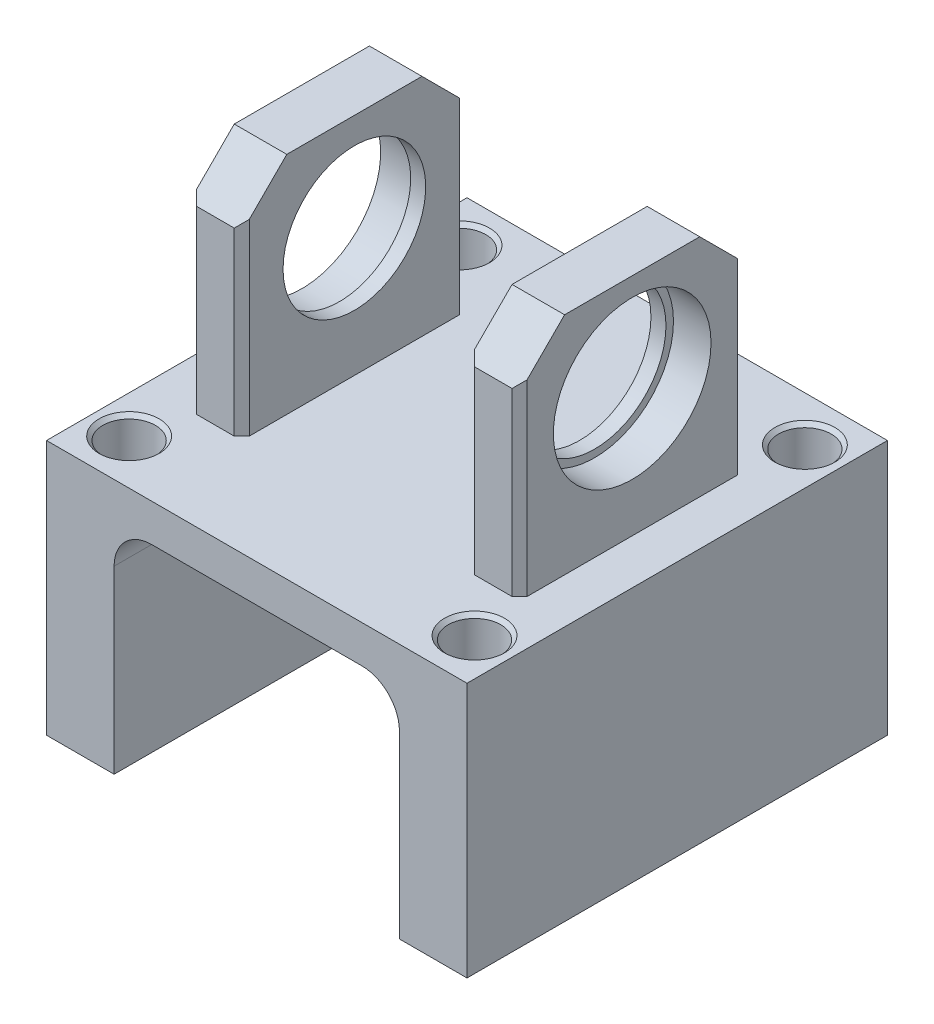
ISO-10303-21;
HEADER;
FILE_DESCRIPTION(('STEP AP214'),'2;1');
FILE_NAME('part.step','',(''),(''),'','','');
FILE_SCHEMA(('AUTOMOTIVE_DESIGN { 1 0 10303 214 1 1 1 1 }'));
ENDSEC;
DATA;
#1=APPLICATION_CONTEXT('core data for automotive mechanical design processes');
#2=APPLICATION_PROTOCOL_DEFINITION('international standard','automotive_design',2000,#1);
#3=PRODUCT_CONTEXT('',#1,'mechanical');
#4=PRODUCT('Part','Part','',(#3));
#5=PRODUCT_RELATED_PRODUCT_CATEGORY('part','',(#4));
#6=PRODUCT_DEFINITION_FORMATION('','',#4);
#7=PRODUCT_DEFINITION_CONTEXT('part definition',#1,'design');
#8=PRODUCT_DEFINITION('design','',#6,#7);
#9=PRODUCT_DEFINITION_SHAPE('','',#8);
#10=(LENGTH_UNIT() NAMED_UNIT(*) SI_UNIT(.MILLI.,.METRE.));
#11=(NAMED_UNIT(*) PLANE_ANGLE_UNIT() SI_UNIT($,.RADIAN.));
#12=(NAMED_UNIT(*) SI_UNIT($,.STERADIAN.) SOLID_ANGLE_UNIT());
#13=UNCERTAINTY_MEASURE_WITH_UNIT(LENGTH_MEASURE(1.E-05),#10,'distance_accuracy_value','');
#14=(GEOMETRIC_REPRESENTATION_CONTEXT(3) GLOBAL_UNCERTAINTY_ASSIGNED_CONTEXT((#13)) GLOBAL_UNIT_ASSIGNED_CONTEXT((#10,
#11,#12)) REPRESENTATION_CONTEXT('',''));
#15=CARTESIAN_POINT('',(0.,0.,0.));
#16=DIRECTION('',(0.,0.,1.));
#17=DIRECTION('',(1.,0.,0.));
#18=AXIS2_PLACEMENT_3D('',#15,#16,#17);
#19=CARTESIAN_POINT('',(-28.,51.,0.));
#20=DIRECTION('',(1.,0.,0.));
#21=DIRECTION('',(0.,0.,-1.));
#22=AXIS2_PLACEMENT_3D('',#19,#20,#21);
#23=CYLINDRICAL_SURFACE('',#22,9.5);
#24=CARTESIAN_POINT('',(-15.,51.,0.));
#25=DIRECTION('',(-1.,0.,0.));
#26=DIRECTION('',(0.,0.,1.));
#27=AXIS2_PLACEMENT_3D('',#24,#25,#26);
#28=CIRCLE('',#27,9.5);
#29=CARTESIAN_POINT('',(-15.,51.,9.5));
#30=VERTEX_POINT('',#29);
#31=EDGE_CURVE('E497',#30,#30,#28,.T.);
#32=ORIENTED_EDGE('',*,*,#31,.F.);
#33=EDGE_LOOP('',(#32));
#34=FACE_BOUND('',#33,.T.);
#35=CARTESIAN_POINT('',(-17.,51.,0.));
#36=DIRECTION('',(-1.,0.,0.));
#37=DIRECTION('',(0.,0.,1.));
#38=AXIS2_PLACEMENT_3D('',#35,#36,#37);
#39=CIRCLE('',#38,9.5);
#40=CARTESIAN_POINT('',(-17.,51.,9.5));
#41=VERTEX_POINT('',#40);
#42=EDGE_CURVE('E399',#41,#41,#39,.F.);
#43=ORIENTED_EDGE('',*,*,#42,.F.);
#44=EDGE_LOOP('',(#43));
#45=FACE_BOUND('',#44,.T.);
#46=ADVANCED_FACE('F37',(#34,#45),#23,.F.);
#47=CARTESIAN_POINT('',(0.,34.,0.));
#48=DIRECTION('',(0.,1.,0.));
#49=DIRECTION('',(0.,0.,1.));
#50=AXIS2_PLACEMENT_3D('',#47,#48,#49);
#51=PLANE('',#50);
#52=CARTESIAN_POINT('',(23.,34.,-22.));
#53=DIRECTION('',(0.,1.,0.));
#54=DIRECTION('',(0.,0.,1.));
#55=AXIS2_PLACEMENT_3D('',#52,#53,#54);
#56=CIRCLE('',#55,3.99999999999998);
#57=CARTESIAN_POINT('',(23.,34.,-18.));
#58=VERTEX_POINT('',#57);
#59=EDGE_CURVE('E415',#58,#58,#56,.F.);
#60=ORIENTED_EDGE('',*,*,#59,.T.);
#61=EDGE_LOOP('',(#60));
#62=FACE_BOUND('',#61,.T.);
#63=CARTESIAN_POINT('',(-23.,34.,22.));
#64=DIRECTION('',(0.,1.,0.));
#65=DIRECTION('',(0.,0.,1.));
#66=AXIS2_PLACEMENT_3D('',#63,#64,#65);
#67=CIRCLE('',#66,3.99999999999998);
#68=CARTESIAN_POINT('',(-23.,34.,26.));
#69=VERTEX_POINT('',#68);
#70=EDGE_CURVE('E412',#69,#69,#67,.F.);
#71=ORIENTED_EDGE('',*,*,#70,.T.);
#72=EDGE_LOOP('',(#71));
#73=FACE_BOUND('',#72,.T.);
#74=CARTESIAN_POINT('',(23.,34.,22.));
#75=DIRECTION('',(0.,1.,0.));
#76=DIRECTION('',(0.,0.,1.));
#77=AXIS2_PLACEMENT_3D('',#74,#75,#76);
#78=CIRCLE('',#77,3.99999999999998);
#79=CARTESIAN_POINT('',(23.,34.,26.));
#80=VERTEX_POINT('',#79);
#81=EDGE_CURVE('E409',#80,#80,#78,.F.);
#82=ORIENTED_EDGE('',*,*,#81,.T.);
#83=EDGE_LOOP('',(#82));
#84=FACE_BOUND('',#83,.T.);
#85=CARTESIAN_POINT('',(-23.,34.,-22.));
#86=DIRECTION('',(0.,1.,0.));
#87=DIRECTION('',(0.,0.,1.));
#88=AXIS2_PLACEMENT_3D('',#85,#86,#87);
#89=CIRCLE('',#88,3.99999999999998);
#90=CARTESIAN_POINT('',(-23.,34.,-18.));
#91=VERTEX_POINT('',#90);
#92=EDGE_CURVE('E406',#91,#91,#89,.F.);
#93=ORIENTED_EDGE('',*,*,#92,.T.);
#94=EDGE_LOOP('',(#93));
#95=FACE_BOUND('',#94,.T.);
#96=DIRECTION('',(0.,0.,-1.));
#97=VECTOR('',#96,1.);
#98=CARTESIAN_POINT('',(28.,34.,-28.));
#99=LINE('',#98,#97);
#100=CARTESIAN_POINT('',(28.,34.,28.));
#101=VERTEX_POINT('',#100);
#102=CARTESIAN_POINT('',(28.,34.,-28.));
#103=VERTEX_POINT('',#102);
#104=EDGE_CURVE('E264',#101,#103,#99,.T.);
#105=ORIENTED_EDGE('',*,*,#104,.T.);
#106=DIRECTION('',(-1.,0.,0.));
#107=VECTOR('',#106,1.);
#108=CARTESIAN_POINT('',(-28.,34.,-28.));
#109=LINE('',#108,#107);
#110=CARTESIAN_POINT('',(-28.,34.,-28.));
#111=VERTEX_POINT('',#110);
#112=EDGE_CURVE('E268',#103,#111,#109,.T.);
#113=ORIENTED_EDGE('',*,*,#112,.T.);
#114=DIRECTION('',(0.,0.,1.));
#115=VECTOR('',#114,1.);
#116=CARTESIAN_POINT('',(-28.,34.,-28.));
#117=LINE('',#116,#115);
#118=CARTESIAN_POINT('',(-28.,34.,28.));
#119=VERTEX_POINT('',#118);
#120=EDGE_CURVE('E577',#111,#119,#117,.T.);
#121=ORIENTED_EDGE('',*,*,#120,.T.);
#122=DIRECTION('',(1.,0.,0.));
#123=VECTOR('',#122,1.);
#124=CARTESIAN_POINT('',(-28.,34.,28.));
#125=LINE('',#124,#123);
#126=EDGE_CURVE('E277',#119,#101,#125,.T.);
#127=ORIENTED_EDGE('',*,*,#126,.T.);
#128=EDGE_LOOP('',(#105,#113,#121,#127));
#129=FACE_BOUND('',#128,.T.);
#130=DIRECTION('',(1.,0.,0.));
#131=VECTOR('',#130,1.);
#132=CARTESIAN_POINT('',(-22.,34.,15.));
#133=LINE('',#132,#131);
#134=CARTESIAN_POINT('',(-21.,34.,15.));
#135=VERTEX_POINT('',#134);
#136=CARTESIAN_POINT('',(-16.,34.,15.));
#137=VERTEX_POINT('',#136);
#138=EDGE_CURVE('E537',#135,#137,#133,.T.);
#139=ORIENTED_EDGE('',*,*,#138,.F.);
#140=DIRECTION('',(0.707106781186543,0.,0.707106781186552));
#141=VECTOR('',#140,1.);
#142=CARTESIAN_POINT('',(-21.,34.,15.));
#143=LINE('',#142,#141);
#144=CARTESIAN_POINT('',(-22.,34.,14.));
#145=VERTEX_POINT('',#144);
#146=EDGE_CURVE('E60',#135,#145,#143,.F.);
#147=ORIENTED_EDGE('',*,*,#146,.T.);
#148=DIRECTION('',(0.,0.,1.));
#149=VECTOR('',#148,1.);
#150=CARTESIAN_POINT('',(-22.,34.,-15.));
#151=LINE('',#150,#149);
#152=CARTESIAN_POINT('',(-22.,34.,-14.));
#153=VERTEX_POINT('',#152);
#154=EDGE_CURVE('E518',#153,#145,#151,.T.);
#155=ORIENTED_EDGE('',*,*,#154,.F.);
#156=DIRECTION('',(-0.707106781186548,0.,0.707106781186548));
#157=VECTOR('',#156,1.);
#158=CARTESIAN_POINT('',(-22.,34.,-14.));
#159=LINE('',#158,#157);
#160=CARTESIAN_POINT('',(-21.,34.,-15.));
#161=VERTEX_POINT('',#160);
#162=EDGE_CURVE('E384',#153,#161,#159,.F.);
#163=ORIENTED_EDGE('',*,*,#162,.T.);
#164=DIRECTION('',(-1.,0.,0.));
#165=VECTOR('',#164,1.);
#166=CARTESIAN_POINT('',(-22.,34.,-15.));
#167=LINE('',#166,#165);
#168=CARTESIAN_POINT('',(-16.,34.,-15.));
#169=VERTEX_POINT('',#168);
#170=EDGE_CURVE('E532',#169,#161,#167,.T.);
#171=ORIENTED_EDGE('',*,*,#170,.F.);
#172=DIRECTION('',(-0.707106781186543,0.,-0.707106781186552));
#173=VECTOR('',#172,1.);
#174=CARTESIAN_POINT('',(-16.,34.,-15.));
#175=LINE('',#174,#173);
#176=CARTESIAN_POINT('',(-15.,34.,-14.));
#177=VERTEX_POINT('',#176);
#178=EDGE_CURVE('E386',#169,#177,#175,.F.);
#179=ORIENTED_EDGE('',*,*,#178,.T.);
#180=DIRECTION('',(0.,0.,-1.));
#181=VECTOR('',#180,1.);
#182=CARTESIAN_POINT('',(-15.,34.,-15.));
#183=LINE('',#182,#181);
#184=CARTESIAN_POINT('',(-15.,34.,14.));
#185=VERTEX_POINT('',#184);
#186=EDGE_CURVE('E539',#185,#177,#183,.T.);
#187=ORIENTED_EDGE('',*,*,#186,.F.);
#188=DIRECTION('',(0.707106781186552,0.,-0.707106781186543));
#189=VECTOR('',#188,1.);
#190=CARTESIAN_POINT('',(-15.,34.,14.));
#191=LINE('',#190,#189);
#192=EDGE_CURVE('E52',#185,#137,#191,.F.);
#193=ORIENTED_EDGE('',*,*,#192,.T.);
#194=EDGE_LOOP('',(#139,#147,#155,#163,#171,#179,#187,#193));
#195=FACE_BOUND('',#194,.T.);
#196=DIRECTION('',(0.,0.,1.));
#197=VECTOR('',#196,1.);
#198=CARTESIAN_POINT('',(15.,34.,-15.));
#199=LINE('',#198,#197);
#200=CARTESIAN_POINT('',(15.,34.,-14.));
#201=VERTEX_POINT('',#200);
#202=CARTESIAN_POINT('',(15.,34.,14.));
#203=VERTEX_POINT('',#202);
#204=EDGE_CURVE('E521',#201,#203,#199,.T.);
#205=ORIENTED_EDGE('',*,*,#204,.F.);
#206=DIRECTION('',(-0.707106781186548,0.,0.707106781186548));
#207=VECTOR('',#206,1.);
#208=CARTESIAN_POINT('',(15.,34.,-14.));
#209=LINE('',#208,#207);
#210=CARTESIAN_POINT('',(16.,34.,-15.));
#211=VERTEX_POINT('',#210);
#212=EDGE_CURVE('E388',#201,#211,#209,.F.);
#213=ORIENTED_EDGE('',*,*,#212,.T.);
#214=DIRECTION('',(-1.,0.,0.));
#215=VECTOR('',#214,1.);
#216=CARTESIAN_POINT('',(22.,34.,-15.));
#217=LINE('',#216,#215);
#218=CARTESIAN_POINT('',(21.,34.,-15.));
#219=VERTEX_POINT('',#218);
#220=EDGE_CURVE('E508',#219,#211,#217,.T.);
#221=ORIENTED_EDGE('',*,*,#220,.F.);
#222=DIRECTION('',(-0.707106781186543,0.,-0.707106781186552));
#223=VECTOR('',#222,1.);
#224=CARTESIAN_POINT('',(21.,34.,-15.));
#225=LINE('',#224,#223);
#226=CARTESIAN_POINT('',(22.,34.,-14.));
#227=VERTEX_POINT('',#226);
#228=EDGE_CURVE('E390',#219,#227,#225,.F.);
#229=ORIENTED_EDGE('',*,*,#228,.T.);
#230=DIRECTION('',(0.,0.,-1.));
#231=VECTOR('',#230,1.);
#232=CARTESIAN_POINT('',(22.,34.,-15.));
#233=LINE('',#232,#231);
#234=CARTESIAN_POINT('',(22.,34.,14.));
#235=VERTEX_POINT('',#234);
#236=EDGE_CURVE('E515',#235,#227,#233,.T.);
#237=ORIENTED_EDGE('',*,*,#236,.F.);
#238=DIRECTION('',(0.707106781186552,0.,-0.707106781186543));
#239=VECTOR('',#238,1.);
#240=CARTESIAN_POINT('',(22.,34.,14.));
#241=LINE('',#240,#239);
#242=CARTESIAN_POINT('',(21.,34.,15.));
#243=VERTEX_POINT('',#242);
#244=EDGE_CURVE('E392',#235,#243,#241,.F.);
#245=ORIENTED_EDGE('',*,*,#244,.T.);
#246=DIRECTION('',(1.,0.,0.));
#247=VECTOR('',#246,1.);
#248=CARTESIAN_POINT('',(22.,34.,15.));
#249=LINE('',#248,#247);
#250=CARTESIAN_POINT('',(16.,34.,15.));
#251=VERTEX_POINT('',#250);
#252=EDGE_CURVE('E524',#251,#243,#249,.T.);
#253=ORIENTED_EDGE('',*,*,#252,.F.);
#254=DIRECTION('',(0.707106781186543,0.,0.707106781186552));
#255=VECTOR('',#254,1.);
#256=CARTESIAN_POINT('',(16.,34.,15.));
#257=LINE('',#256,#255);
#258=EDGE_CURVE('E394',#251,#203,#257,.F.);
#259=ORIENTED_EDGE('',*,*,#258,.T.);
#260=EDGE_LOOP('',(#205,#213,#221,#229,#237,#245,#253,#259));
#261=FACE_BOUND('',#260,.T.);
#262=ADVANCED_FACE('F464',(#62,#73,#84,#95,#129,#195,#261),#51,.T.);
#263=CARTESIAN_POINT('',(0.,0.,0.));
#264=DIRECTION('',(0.,1.,0.));
#265=DIRECTION('',(0.,0.,1.));
#266=AXIS2_PLACEMENT_3D('',#263,#264,#265);
#267=PLANE('',#266);
#268=CARTESIAN_POINT('',(-23.,0.,22.));
#269=DIRECTION('',(0.,1.,0.));
#270=DIRECTION('',(0.,0.,1.));
#271=AXIS2_PLACEMENT_3D('',#268,#269,#270);
#272=CIRCLE('',#271,2.99999999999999);
#273=CARTESIAN_POINT('',(-23.,0.,25.));
#274=VERTEX_POINT('',#273);
#275=EDGE_CURVE('E424',#274,#274,#272,.T.);
#276=ORIENTED_EDGE('',*,*,#275,.T.);
#277=EDGE_LOOP('',(#276));
#278=FACE_BOUND('',#277,.T.);
#279=CARTESIAN_POINT('',(-23.,0.,-22.));
#280=DIRECTION('',(0.,1.,0.));
#281=DIRECTION('',(0.,0.,1.));
#282=AXIS2_PLACEMENT_3D('',#279,#280,#281);
#283=CIRCLE('',#282,2.99999999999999);
#284=CARTESIAN_POINT('',(-23.,0.,-19.));
#285=VERTEX_POINT('',#284);
#286=EDGE_CURVE('E421',#285,#285,#283,.T.);
#287=ORIENTED_EDGE('',*,*,#286,.T.);
#288=EDGE_LOOP('',(#287));
#289=FACE_BOUND('',#288,.T.);
#290=DIRECTION('',(-1.,0.,0.));
#291=VECTOR('',#290,1.);
#292=CARTESIAN_POINT('',(-28.,0.,-28.));
#293=LINE('',#292,#291);
#294=CARTESIAN_POINT('',(-19.,0.,-28.));
#295=VERTEX_POINT('',#294);
#296=CARTESIAN_POINT('',(-28.,0.,-28.));
#297=VERTEX_POINT('',#296);
#298=EDGE_CURVE('E255',#295,#297,#293,.T.);
#299=ORIENTED_EDGE('',*,*,#298,.F.);
#300=DIRECTION('',(0.,0.,1.));
#301=VECTOR('',#300,1.);
#302=CARTESIAN_POINT('',(-19.,0.,-28.));
#303=LINE('',#302,#301);
#304=CARTESIAN_POINT('',(-19.,0.,28.));
#305=VERTEX_POINT('',#304);
#306=EDGE_CURVE('E239',#295,#305,#303,.T.);
#307=ORIENTED_EDGE('',*,*,#306,.T.);
#308=DIRECTION('',(1.,0.,0.));
#309=VECTOR('',#308,1.);
#310=CARTESIAN_POINT('',(-28.,0.,28.));
#311=LINE('',#310,#309);
#312=CARTESIAN_POINT('',(-28.,0.,28.));
#313=VERTEX_POINT('',#312);
#314=EDGE_CURVE('E254',#313,#305,#311,.T.);
#315=ORIENTED_EDGE('',*,*,#314,.F.);
#316=DIRECTION('',(0.,0.,1.));
#317=VECTOR('',#316,1.);
#318=CARTESIAN_POINT('',(-28.,0.,-28.));
#319=LINE('',#318,#317);
#320=EDGE_CURVE('E270',#297,#313,#319,.T.);
#321=ORIENTED_EDGE('',*,*,#320,.F.);
#322=EDGE_LOOP('',(#299,#307,#315,#321));
#323=FACE_BOUND('',#322,.T.);
#324=ADVANCED_FACE('F252',(#278,#289,#323),#267,.F.);
#325=CARTESIAN_POINT('',(28.,34.,-28.));
#326=DIRECTION('',(-1.,0.,0.));
#327=DIRECTION('',(0.,0.,1.));
#328=AXIS2_PLACEMENT_3D('',#325,#326,#327);
#329=PLANE('',#328);
#330=DIRECTION('',(0.,0.,-1.));
#331=VECTOR('',#330,1.);
#332=CARTESIAN_POINT('',(28.,0.,-28.));
#333=LINE('',#332,#331);
#334=CARTESIAN_POINT('',(28.,0.,28.));
#335=VERTEX_POINT('',#334);
#336=CARTESIAN_POINT('',(28.,0.,-28.));
#337=VERTEX_POINT('',#336);
#338=EDGE_CURVE('E568',#335,#337,#333,.T.);
#339=ORIENTED_EDGE('',*,*,#338,.T.);
#340=DIRECTION('',(0.,-1.,0.));
#341=VECTOR('',#340,1.);
#342=CARTESIAN_POINT('',(28.,34.,-28.));
#343=LINE('',#342,#341);
#344=EDGE_CURVE('E282',#103,#337,#343,.T.);
#345=ORIENTED_EDGE('',*,*,#344,.F.);
#346=ORIENTED_EDGE('',*,*,#104,.F.);
#347=DIRECTION('',(0.,-1.,0.));
#348=VECTOR('',#347,1.);
#349=CARTESIAN_POINT('',(28.,34.,28.));
#350=LINE('',#349,#348);
#351=EDGE_CURVE('E274',#101,#335,#350,.T.);
#352=ORIENTED_EDGE('',*,*,#351,.T.);
#353=EDGE_LOOP('',(#339,#345,#346,#352));
#354=FACE_BOUND('',#353,.T.);
#355=ADVANCED_FACE('F595',(#354),#329,.F.);
#356=CARTESIAN_POINT('',(-28.,34.,-28.));
#357=DIRECTION('',(0.,0.,1.));
#358=DIRECTION('',(1.,0.,0.));
#359=AXIS2_PLACEMENT_3D('',#356,#357,#358);
#360=PLANE('',#359);
#361=CARTESIAN_POINT('',(-14.,24.,-28.));
#362=DIRECTION('',(0.,0.,1.));
#363=DIRECTION('',(-1.,0.,0.));
#364=AXIS2_PLACEMENT_3D('',#361,#362,#363);
#365=CIRCLE('',#364,5.);
#366=CARTESIAN_POINT('',(-14.,29.,-28.));
#367=VERTEX_POINT('',#366);
#368=CARTESIAN_POINT('',(-19.,24.,-28.));
#369=VERTEX_POINT('',#368);
#370=EDGE_CURVE('E257',#367,#369,#365,.T.);
#371=ORIENTED_EDGE('',*,*,#370,.T.);
#372=DIRECTION('',(0.,-1.,0.));
#373=VECTOR('',#372,1.);
#374=CARTESIAN_POINT('',(-19.,0.,-28.));
#375=LINE('',#374,#373);
#376=EDGE_CURVE('E554',#369,#295,#375,.T.);
#377=ORIENTED_EDGE('',*,*,#376,.T.);
#378=ORIENTED_EDGE('',*,*,#298,.T.);
#379=DIRECTION('',(0.,-1.,0.));
#380=VECTOR('',#379,1.);
#381=CARTESIAN_POINT('',(-28.,34.,-28.));
#382=LINE('',#381,#380);
#383=EDGE_CURVE('E279',#111,#297,#382,.T.);
#384=ORIENTED_EDGE('',*,*,#383,.F.);
#385=ORIENTED_EDGE('',*,*,#112,.F.);
#386=ORIENTED_EDGE('',*,*,#344,.T.);
#387=CARTESIAN_POINT('',(19.,0.,-28.));
#388=VERTEX_POINT('',#387);
#389=EDGE_CURVE('E581',#337,#388,#293,.T.);
#390=ORIENTED_EDGE('',*,*,#389,.T.);
#391=DIRECTION('',(0.,1.,0.));
#392=VECTOR('',#391,1.);
#393=CARTESIAN_POINT('',(19.,0.,-28.));
#394=LINE('',#393,#392);
#395=CARTESIAN_POINT('',(19.,24.,-28.));
#396=VERTEX_POINT('',#395);
#397=EDGE_CURVE('E556',#388,#396,#394,.T.);
#398=ORIENTED_EDGE('',*,*,#397,.T.);
#399=CARTESIAN_POINT('',(14.,24.,-28.));
#400=DIRECTION('',(0.,0.,1.));
#401=DIRECTION('',(1.,0.,0.));
#402=AXIS2_PLACEMENT_3D('',#399,#400,#401);
#403=CIRCLE('',#402,5.);
#404=CARTESIAN_POINT('',(14.,29.,-28.));
#405=VERTEX_POINT('',#404);
#406=EDGE_CURVE('E559',#396,#405,#403,.T.);
#407=ORIENTED_EDGE('',*,*,#406,.T.);
#408=DIRECTION('',(-1.,0.,0.));
#409=VECTOR('',#408,1.);
#410=CARTESIAN_POINT('',(-14.,29.,-28.));
#411=LINE('',#410,#409);
#412=EDGE_CURVE('E562',#405,#367,#411,.T.);
#413=ORIENTED_EDGE('',*,*,#412,.T.);
#414=EDGE_LOOP('',(#371,#377,#378,#384,#385,#386,#390,#398,#407,#413));
#415=FACE_BOUND('',#414,.T.);
#416=ADVANCED_FACE('F585',(#415),#360,.F.);
#417=CARTESIAN_POINT('',(-28.,34.,-28.));
#418=DIRECTION('',(1.,0.,0.));
#419=DIRECTION('',(0.,0.,-1.));
#420=AXIS2_PLACEMENT_3D('',#417,#418,#419);
#421=PLANE('',#420);
#422=ORIENTED_EDGE('',*,*,#320,.T.);
#423=DIRECTION('',(0.,-1.,0.));
#424=VECTOR('',#423,1.);
#425=CARTESIAN_POINT('',(-28.,34.,28.));
#426=LINE('',#425,#424);
#427=EDGE_CURVE('E263',#119,#313,#426,.T.);
#428=ORIENTED_EDGE('',*,*,#427,.F.);
#429=ORIENTED_EDGE('',*,*,#120,.F.);
#430=ORIENTED_EDGE('',*,*,#383,.T.);
#431=EDGE_LOOP('',(#422,#428,#429,#430));
#432=FACE_BOUND('',#431,.T.);
#433=ADVANCED_FACE('F588',(#432),#421,.F.);
#434=CARTESIAN_POINT('',(-28.,34.,28.));
#435=DIRECTION('',(0.,0.,-1.));
#436=DIRECTION('',(-1.,0.,0.));
#437=AXIS2_PLACEMENT_3D('',#434,#435,#436);
#438=PLANE('',#437);
#439=ORIENTED_EDGE('',*,*,#314,.T.);
#440=DIRECTION('',(0.,-1.,0.));
#441=VECTOR('',#440,1.);
#442=CARTESIAN_POINT('',(-19.,0.,28.));
#443=LINE('',#442,#441);
#444=CARTESIAN_POINT('',(-19.,24.,28.));
#445=VERTEX_POINT('',#444);
#446=EDGE_CURVE('E235',#445,#305,#443,.T.);
#447=ORIENTED_EDGE('',*,*,#446,.F.);
#448=CARTESIAN_POINT('',(-14.,24.,28.));
#449=DIRECTION('',(0.,0.,1.));
#450=DIRECTION('',(-1.,0.,0.));
#451=AXIS2_PLACEMENT_3D('',#448,#449,#450);
#452=CIRCLE('',#451,5.);
#453=CARTESIAN_POINT('',(-14.,29.,28.));
#454=VERTEX_POINT('',#453);
#455=EDGE_CURVE('E552',#454,#445,#452,.T.);
#456=ORIENTED_EDGE('',*,*,#455,.F.);
#457=DIRECTION('',(-1.,0.,0.));
#458=VECTOR('',#457,1.);
#459=CARTESIAN_POINT('',(-14.,29.,28.));
#460=LINE('',#459,#458);
#461=CARTESIAN_POINT('',(14.,29.,28.));
#462=VERTEX_POINT('',#461);
#463=EDGE_CURVE('E549',#462,#454,#460,.T.);
#464=ORIENTED_EDGE('',*,*,#463,.F.);
#465=CARTESIAN_POINT('',(14.,24.,28.));
#466=DIRECTION('',(0.,0.,1.));
#467=DIRECTION('',(1.,0.,0.));
#468=AXIS2_PLACEMENT_3D('',#465,#466,#467);
#469=CIRCLE('',#468,5.);
#470=CARTESIAN_POINT('',(19.,24.,28.));
#471=VERTEX_POINT('',#470);
#472=EDGE_CURVE('E546',#471,#462,#469,.T.);
#473=ORIENTED_EDGE('',*,*,#472,.F.);
#474=DIRECTION('',(0.,1.,0.));
#475=VECTOR('',#474,1.);
#476=CARTESIAN_POINT('',(19.,0.,28.));
#477=LINE('',#476,#475);
#478=CARTESIAN_POINT('',(19.,0.,28.));
#479=VERTEX_POINT('',#478);
#480=EDGE_CURVE('E246',#479,#471,#477,.T.);
#481=ORIENTED_EDGE('',*,*,#480,.F.);
#482=EDGE_CURVE('E265',#479,#335,#311,.T.);
#483=ORIENTED_EDGE('',*,*,#482,.T.);
#484=ORIENTED_EDGE('',*,*,#351,.F.);
#485=ORIENTED_EDGE('',*,*,#126,.F.);
#486=ORIENTED_EDGE('',*,*,#427,.T.);
#487=EDGE_LOOP('',(#439,#447,#456,#464,#473,#481,#483,#484,#485,#486));
#488=FACE_BOUND('',#487,.T.);
#489=ADVANCED_FACE('F260',(#488),#438,.F.);
#490=CARTESIAN_POINT('',(23.,0.,22.));
#491=DIRECTION('',(0.,1.,0.));
#492=DIRECTION('',(0.,0.,1.));
#493=AXIS2_PLACEMENT_3D('',#490,#491,#492);
#494=CIRCLE('',#493,2.99999999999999);
#495=CARTESIAN_POINT('',(23.,0.,25.));
#496=VERTEX_POINT('',#495);
#497=EDGE_CURVE('E433',#496,#496,#494,.T.);
#498=ORIENTED_EDGE('',*,*,#497,.T.);
#499=EDGE_LOOP('',(#498));
#500=FACE_BOUND('',#499,.T.);
#501=CARTESIAN_POINT('',(23.,0.,-22.));
#502=DIRECTION('',(0.,1.,0.));
#503=DIRECTION('',(0.,0.,1.));
#504=AXIS2_PLACEMENT_3D('',#501,#502,#503);
#505=CIRCLE('',#504,2.99999999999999);
#506=CARTESIAN_POINT('',(23.,0.,-19.));
#507=VERTEX_POINT('',#506);
#508=EDGE_CURVE('E430',#507,#507,#505,.T.);
#509=ORIENTED_EDGE('',*,*,#508,.T.);
#510=EDGE_LOOP('',(#509));
#511=FACE_BOUND('',#510,.T.);
#512=ORIENTED_EDGE('',*,*,#482,.F.);
#513=DIRECTION('',(0.,0.,1.));
#514=VECTOR('',#513,1.);
#515=CARTESIAN_POINT('',(19.,0.,-28.));
#516=LINE('',#515,#514);
#517=EDGE_CURVE('E256',#388,#479,#516,.T.);
#518=ORIENTED_EDGE('',*,*,#517,.F.);
#519=ORIENTED_EDGE('',*,*,#389,.F.);
#520=ORIENTED_EDGE('',*,*,#338,.F.);
#521=EDGE_LOOP('',(#512,#518,#519,#520));
#522=FACE_BOUND('',#521,.T.);
#523=ADVANCED_FACE('F598',(#500,#511,#522),#267,.F.);
#524=CARTESIAN_POINT('',(-19.,0.,-28.));
#525=DIRECTION('',(-1.,0.,0.));
#526=DIRECTION('',(0.,0.,1.));
#527=AXIS2_PLACEMENT_3D('',#524,#525,#526);
#528=PLANE('',#527);
#529=ORIENTED_EDGE('',*,*,#306,.F.);
#530=ORIENTED_EDGE('',*,*,#376,.F.);
#531=DIRECTION('',(0.,0.,1.));
#532=VECTOR('',#531,1.);
#533=CARTESIAN_POINT('',(-19.,24.,-28.));
#534=LINE('',#533,#532);
#535=EDGE_CURVE('E241',#369,#445,#534,.T.);
#536=ORIENTED_EDGE('',*,*,#535,.T.);
#537=ORIENTED_EDGE('',*,*,#446,.T.);
#538=EDGE_LOOP('',(#529,#530,#536,#537));
#539=FACE_BOUND('',#538,.T.);
#540=ADVANCED_FACE('F237',(#539),#528,.F.);
#541=CARTESIAN_POINT('',(-14.,24.,-28.));
#542=DIRECTION('',(0.,0.,1.));
#543=DIRECTION('',(1.,0.,0.));
#544=AXIS2_PLACEMENT_3D('',#541,#542,#543);
#545=CYLINDRICAL_SURFACE('',#544,5.);
#546=ORIENTED_EDGE('',*,*,#535,.F.);
#547=ORIENTED_EDGE('',*,*,#370,.F.);
#548=DIRECTION('',(0.,0.,1.));
#549=VECTOR('',#548,1.);
#550=CARTESIAN_POINT('',(-14.,29.,-28.));
#551=LINE('',#550,#549);
#552=EDGE_CURVE('E569',#367,#454,#551,.T.);
#553=ORIENTED_EDGE('',*,*,#552,.T.);
#554=ORIENTED_EDGE('',*,*,#455,.T.);
#555=EDGE_LOOP('',(#546,#547,#553,#554));
#556=FACE_BOUND('',#555,.T.);
#557=ADVANCED_FACE('F613',(#556),#545,.F.);
#558=CARTESIAN_POINT('',(-14.,29.,-28.));
#559=DIRECTION('',(0.,1.,0.));
#560=DIRECTION('',(0.,0.,1.));
#561=AXIS2_PLACEMENT_3D('',#558,#559,#560);
#562=PLANE('',#561);
#563=ORIENTED_EDGE('',*,*,#552,.F.);
#564=ORIENTED_EDGE('',*,*,#412,.F.);
#565=DIRECTION('',(0.,0.,1.));
#566=VECTOR('',#565,1.);
#567=CARTESIAN_POINT('',(14.,29.,-28.));
#568=LINE('',#567,#566);
#569=EDGE_CURVE('E571',#405,#462,#568,.T.);
#570=ORIENTED_EDGE('',*,*,#569,.T.);
#571=ORIENTED_EDGE('',*,*,#463,.T.);
#572=EDGE_LOOP('',(#563,#564,#570,#571));
#573=FACE_BOUND('',#572,.T.);
#574=ADVANCED_FACE('F611',(#573),#562,.F.);
#575=CARTESIAN_POINT('',(14.,24.,-28.));
#576=DIRECTION('',(0.,0.,1.));
#577=DIRECTION('',(1.,0.,0.));
#578=AXIS2_PLACEMENT_3D('',#575,#576,#577);
#579=CYLINDRICAL_SURFACE('',#578,5.);
#580=ORIENTED_EDGE('',*,*,#569,.F.);
#581=ORIENTED_EDGE('',*,*,#406,.F.);
#582=DIRECTION('',(0.,0.,1.));
#583=VECTOR('',#582,1.);
#584=CARTESIAN_POINT('',(19.,24.,-28.));
#585=LINE('',#584,#583);
#586=EDGE_CURVE('E573',#396,#471,#585,.T.);
#587=ORIENTED_EDGE('',*,*,#586,.T.);
#588=ORIENTED_EDGE('',*,*,#472,.T.);
#589=EDGE_LOOP('',(#580,#581,#587,#588));
#590=FACE_BOUND('',#589,.T.);
#591=ADVANCED_FACE('F606',(#590),#579,.F.);
#592=CARTESIAN_POINT('',(19.,0.,-28.));
#593=DIRECTION('',(1.,0.,0.));
#594=DIRECTION('',(0.,1.,0.));
#595=AXIS2_PLACEMENT_3D('',#592,#593,#594);
#596=PLANE('',#595);
#597=ORIENTED_EDGE('',*,*,#586,.F.);
#598=ORIENTED_EDGE('',*,*,#397,.F.);
#599=ORIENTED_EDGE('',*,*,#517,.T.);
#600=ORIENTED_EDGE('',*,*,#480,.T.);
#601=EDGE_LOOP('',(#597,#598,#599,#600));
#602=FACE_BOUND('',#601,.T.);
#603=ADVANCED_FACE('F602',(#602),#596,.F.);
#604=CARTESIAN_POINT('',(-22.,64.,-15.));
#605=DIRECTION('',(1.,0.,0.));
#606=DIRECTION('',(0.,0.,-1.));
#607=AXIS2_PLACEMENT_3D('',#604,#605,#606);
#608=PLANE('',#607);
#609=CARTESIAN_POINT('',(-22.,51.,0.));
#610=DIRECTION('',(-1.,0.,0.));
#611=DIRECTION('',(0.,0.,1.));
#612=AXIS2_PLACEMENT_3D('',#609,#610,#611);
#613=CIRCLE('',#612,10.5);
#614=CARTESIAN_POINT('',(-22.,51.,10.5));
#615=VERTEX_POINT('',#614);
#616=EDGE_CURVE('E740',#615,#615,#613,.T.);
#617=ORIENTED_EDGE('',*,*,#616,.F.);
#618=EDGE_LOOP('',(#617));
#619=FACE_BOUND('',#618,.T.);
#620=DIRECTION('',(0.,-0.707106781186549,-0.707106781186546));
#621=VECTOR('',#620,1.);
#622=CARTESIAN_POINT('',(-22.,64.,-9.00000000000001));
#623=LINE('',#622,#621);
#624=CARTESIAN_POINT('',(-22.,64.,-9.00000000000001));
#625=VERTEX_POINT('',#624);
#626=CARTESIAN_POINT('',(-22.,59.,-14.));
#627=VERTEX_POINT('',#626);
#628=EDGE_CURVE('E293',#625,#627,#623,.T.);
#629=ORIENTED_EDGE('',*,*,#628,.T.);
#630=DIRECTION('',(0.,-1.,0.));
#631=VECTOR('',#630,1.);
#632=CARTESIAN_POINT('',(-22.,64.,-14.));
#633=LINE('',#632,#631);
#634=EDGE_CURVE('E331',#627,#153,#633,.T.);
#635=ORIENTED_EDGE('',*,*,#634,.T.);
#636=ORIENTED_EDGE('',*,*,#154,.T.);
#637=DIRECTION('',(0.,1.,0.));
#638=VECTOR('',#637,1.);
#639=CARTESIAN_POINT('',(-22.,64.,14.));
#640=LINE('',#639,#638);
#641=CARTESIAN_POINT('',(-22.,59.,14.));
#642=VERTEX_POINT('',#641);
#643=EDGE_CURVE('E329',#145,#642,#640,.T.);
#644=ORIENTED_EDGE('',*,*,#643,.T.);
#645=DIRECTION('',(0.,0.707106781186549,-0.707106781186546));
#646=VECTOR('',#645,1.);
#647=CARTESIAN_POINT('',(-22.,64.,9.));
#648=LINE('',#647,#646);
#649=CARTESIAN_POINT('',(-22.,64.,9.));
#650=VERTEX_POINT('',#649);
#651=EDGE_CURVE('E291',#642,#650,#648,.T.);
#652=ORIENTED_EDGE('',*,*,#651,.T.);
#653=DIRECTION('',(0.,0.,1.));
#654=VECTOR('',#653,1.);
#655=CARTESIAN_POINT('',(-22.,64.,-15.));
#656=LINE('',#655,#654);
#657=EDGE_CURVE('E529',#625,#650,#656,.T.);
#658=ORIENTED_EDGE('',*,*,#657,.F.);
#659=EDGE_LOOP('',(#629,#635,#636,#644,#652,#658));
#660=FACE_BOUND('',#659,.T.);
#661=ADVANCED_FACE('F623',(#619,#660),#608,.F.);
#662=CARTESIAN_POINT('',(-22.,64.,15.));
#663=DIRECTION('',(0.,0.,-1.));
#664=DIRECTION('',(-1.,0.,0.));
#665=AXIS2_PLACEMENT_3D('',#662,#663,#664);
#666=PLANE('',#665);
#667=ORIENTED_EDGE('',*,*,#138,.T.);
#668=DIRECTION('',(0.,1.,0.));
#669=VECTOR('',#668,1.);
#670=CARTESIAN_POINT('',(-16.,64.,15.));
#671=LINE('',#670,#669);
#672=CARTESIAN_POINT('',(-16.,58.,15.));
#673=VERTEX_POINT('',#672);
#674=EDGE_CURVE('E378',#137,#673,#671,.T.);
#675=ORIENTED_EDGE('',*,*,#674,.T.);
#676=DIRECTION('',(-1.,0.,0.));
#677=VECTOR('',#676,1.);
#678=CARTESIAN_POINT('',(-22.,58.,15.));
#679=LINE('',#678,#677);
#680=CARTESIAN_POINT('',(-21.,58.,15.));
#681=VERTEX_POINT('',#680);
#682=EDGE_CURVE('E304',#673,#681,#679,.T.);
#683=ORIENTED_EDGE('',*,*,#682,.T.);
#684=DIRECTION('',(0.,-1.,0.));
#685=VECTOR('',#684,1.);
#686=CARTESIAN_POINT('',(-21.,64.,15.));
#687=LINE('',#686,#685);
#688=EDGE_CURVE('E376',#681,#135,#687,.T.);
#689=ORIENTED_EDGE('',*,*,#688,.T.);
#690=EDGE_LOOP('',(#667,#675,#683,#689));
#691=FACE_BOUND('',#690,.T.);
#692=ADVANCED_FACE('F758',(#691),#666,.F.);
#693=CARTESIAN_POINT('',(-15.,64.,-15.));
#694=DIRECTION('',(-1.,0.,0.));
#695=DIRECTION('',(0.,0.,1.));
#696=AXIS2_PLACEMENT_3D('',#693,#694,#695);
#697=PLANE('',#696);
#698=ORIENTED_EDGE('',*,*,#31,.T.);
#699=EDGE_LOOP('',(#698));
#700=FACE_BOUND('',#699,.T.);
#701=ORIENTED_EDGE('',*,*,#186,.T.);
#702=DIRECTION('',(0.,1.,0.));
#703=VECTOR('',#702,1.);
#704=CARTESIAN_POINT('',(-15.,64.,-14.));
#705=LINE('',#704,#703);
#706=CARTESIAN_POINT('',(-15.,59.,-14.));
#707=VERTEX_POINT('',#706);
#708=EDGE_CURVE('E346',#177,#707,#705,.T.);
#709=ORIENTED_EDGE('',*,*,#708,.T.);
#710=DIRECTION('',(0.,0.707106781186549,0.707106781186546));
#711=VECTOR('',#710,1.);
#712=CARTESIAN_POINT('',(-15.,64.,-9.00000000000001));
#713=LINE('',#712,#711);
#714=CARTESIAN_POINT('',(-15.,64.,-9.00000000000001));
#715=VERTEX_POINT('',#714);
#716=EDGE_CURVE('E302',#707,#715,#713,.T.);
#717=ORIENTED_EDGE('',*,*,#716,.T.);
#718=DIRECTION('',(0.,0.,-1.));
#719=VECTOR('',#718,1.);
#720=CARTESIAN_POINT('',(-15.,64.,-15.));
#721=LINE('',#720,#719);
#722=CARTESIAN_POINT('',(-15.,64.,9.));
#723=VERTEX_POINT('',#722);
#724=EDGE_CURVE('E247',#723,#715,#721,.T.);
#725=ORIENTED_EDGE('',*,*,#724,.F.);
#726=DIRECTION('',(0.,-0.707106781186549,0.707106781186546));
#727=VECTOR('',#726,1.);
#728=CARTESIAN_POINT('',(-15.,64.,9.));
#729=LINE('',#728,#727);
#730=CARTESIAN_POINT('',(-15.,59.,14.));
#731=VERTEX_POINT('',#730);
#732=EDGE_CURVE('E299',#723,#731,#729,.T.);
#733=ORIENTED_EDGE('',*,*,#732,.T.);
#734=DIRECTION('',(0.,-1.,0.));
#735=VECTOR('',#734,1.);
#736=CARTESIAN_POINT('',(-15.,64.,14.));
#737=LINE('',#736,#735);
#738=EDGE_CURVE('E343',#731,#185,#737,.T.);
#739=ORIENTED_EDGE('',*,*,#738,.T.);
#740=EDGE_LOOP('',(#701,#709,#717,#725,#733,#739));
#741=FACE_BOUND('',#740,.T.);
#742=ADVANCED_FACE('F774',(#700,#741),#697,.F.);
#743=CARTESIAN_POINT('',(-22.,64.,-15.));
#744=DIRECTION('',(0.,0.,1.));
#745=DIRECTION('',(1.,0.,0.));
#746=AXIS2_PLACEMENT_3D('',#743,#744,#745);
#747=PLANE('',#746);
#748=ORIENTED_EDGE('',*,*,#170,.T.);
#749=DIRECTION('',(0.,1.,0.));
#750=VECTOR('',#749,1.);
#751=CARTESIAN_POINT('',(-21.,64.,-15.));
#752=LINE('',#751,#750);
#753=CARTESIAN_POINT('',(-21.,58.,-15.));
#754=VERTEX_POINT('',#753);
#755=EDGE_CURVE('E337',#161,#754,#752,.T.);
#756=ORIENTED_EDGE('',*,*,#755,.T.);
#757=DIRECTION('',(1.,0.,0.));
#758=VECTOR('',#757,1.);
#759=CARTESIAN_POINT('',(-15.,58.,-15.));
#760=LINE('',#759,#758);
#761=CARTESIAN_POINT('',(-16.,58.,-15.));
#762=VERTEX_POINT('',#761);
#763=EDGE_CURVE('E296',#754,#762,#760,.T.);
#764=ORIENTED_EDGE('',*,*,#763,.T.);
#765=DIRECTION('',(0.,-1.,0.));
#766=VECTOR('',#765,1.);
#767=CARTESIAN_POINT('',(-16.,64.,-15.));
#768=LINE('',#767,#766);
#769=EDGE_CURVE('E334',#762,#169,#768,.T.);
#770=ORIENTED_EDGE('',*,*,#769,.T.);
#771=EDGE_LOOP('',(#748,#756,#764,#770));
#772=FACE_BOUND('',#771,.T.);
#773=ADVANCED_FACE('F768',(#772),#747,.F.);
#774=CARTESIAN_POINT('',(0.,64.,0.));
#775=DIRECTION('',(0.,1.,0.));
#776=DIRECTION('',(0.,0.,1.));
#777=AXIS2_PLACEMENT_3D('',#774,#775,#776);
#778=PLANE('',#777);
#779=ORIENTED_EDGE('',*,*,#724,.T.);
#780=DIRECTION('',(-1.,0.,0.));
#781=VECTOR('',#780,1.);
#782=CARTESIAN_POINT('',(-22.,64.,-9.00000000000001));
#783=LINE('',#782,#781);
#784=EDGE_CURVE('E288',#715,#625,#783,.T.);
#785=ORIENTED_EDGE('',*,*,#784,.T.);
#786=ORIENTED_EDGE('',*,*,#657,.T.);
#787=DIRECTION('',(1.,0.,0.));
#788=VECTOR('',#787,1.);
#789=CARTESIAN_POINT('',(-15.,64.,9.));
#790=LINE('',#789,#788);
#791=EDGE_CURVE('E285',#650,#723,#790,.T.);
#792=ORIENTED_EDGE('',*,*,#791,.T.);
#793=EDGE_LOOP('',(#779,#785,#786,#792));
#794=FACE_BOUND('',#793,.T.);
#795=ADVANCED_FACE('F786',(#794),#778,.T.);
#796=CARTESIAN_POINT('',(22.,64.,-15.));
#797=DIRECTION('',(0.,0.,1.));
#798=DIRECTION('',(1.,0.,0.));
#799=AXIS2_PLACEMENT_3D('',#796,#797,#798);
#800=PLANE('',#799);
#801=ORIENTED_EDGE('',*,*,#220,.T.);
#802=DIRECTION('',(0.,1.,0.));
#803=VECTOR('',#802,1.);
#804=CARTESIAN_POINT('',(16.,64.,-15.));
#805=LINE('',#804,#803);
#806=CARTESIAN_POINT('',(16.,58.,-15.));
#807=VERTEX_POINT('',#806);
#808=EDGE_CURVE('E356',#211,#807,#805,.T.);
#809=ORIENTED_EDGE('',*,*,#808,.T.);
#810=DIRECTION('',(1.,0.,0.));
#811=VECTOR('',#810,1.);
#812=CARTESIAN_POINT('',(22.,58.,-15.));
#813=LINE('',#812,#811);
#814=CARTESIAN_POINT('',(21.,58.,-15.));
#815=VERTEX_POINT('',#814);
#816=EDGE_CURVE('E326',#807,#815,#813,.T.);
#817=ORIENTED_EDGE('',*,*,#816,.T.);
#818=DIRECTION('',(0.,-1.,0.));
#819=VECTOR('',#818,1.);
#820=CARTESIAN_POINT('',(21.,64.,-15.));
#821=LINE('',#820,#819);
#822=EDGE_CURVE('E353',#815,#219,#821,.T.);
#823=ORIENTED_EDGE('',*,*,#822,.T.);
#824=EDGE_LOOP('',(#801,#809,#817,#823));
#825=FACE_BOUND('',#824,.T.);
#826=ADVANCED_FACE('F788',(#825),#800,.F.);
#827=CARTESIAN_POINT('',(15.,64.,-15.));
#828=DIRECTION('',(1.,0.,0.));
#829=DIRECTION('',(0.,0.,-1.));
#830=AXIS2_PLACEMENT_3D('',#827,#828,#829);
#831=PLANE('',#830);
#832=CARTESIAN_POINT('',(15.,51.,0.));
#833=DIRECTION('',(1.,0.,0.));
#834=DIRECTION('',(0.,0.,-1.));
#835=AXIS2_PLACEMENT_3D('',#832,#833,#834);
#836=CIRCLE('',#835,9.5);
#837=CARTESIAN_POINT('',(15.,51.,-9.5));
#838=VERTEX_POINT('',#837);
#839=EDGE_CURVE('E495',#838,#838,#836,.T.);
#840=ORIENTED_EDGE('',*,*,#839,.T.);
#841=EDGE_LOOP('',(#840));
#842=FACE_BOUND('',#841,.T.);
#843=DIRECTION('',(0.,-0.707106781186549,-0.707106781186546));
#844=VECTOR('',#843,1.);
#845=CARTESIAN_POINT('',(15.,64.,-9.00000000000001));
#846=LINE('',#845,#844);
#847=CARTESIAN_POINT('',(15.,64.,-9.00000000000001));
#848=VERTEX_POINT('',#847);
#849=CARTESIAN_POINT('',(15.,59.,-14.));
#850=VERTEX_POINT('',#849);
#851=EDGE_CURVE('E321',#848,#850,#846,.T.);
#852=ORIENTED_EDGE('',*,*,#851,.T.);
#853=DIRECTION('',(0.,-1.,0.));
#854=VECTOR('',#853,1.);
#855=CARTESIAN_POINT('',(15.,64.,-14.));
#856=LINE('',#855,#854);
#857=EDGE_CURVE('E350',#850,#201,#856,.T.);
#858=ORIENTED_EDGE('',*,*,#857,.T.);
#859=ORIENTED_EDGE('',*,*,#204,.T.);
#860=DIRECTION('',(0.,1.,0.));
#861=VECTOR('',#860,1.);
#862=CARTESIAN_POINT('',(15.,64.,14.));
#863=LINE('',#862,#861);
#864=CARTESIAN_POINT('',(15.,59.,14.));
#865=VERTEX_POINT('',#864);
#866=EDGE_CURVE('E348',#203,#865,#863,.T.);
#867=ORIENTED_EDGE('',*,*,#866,.T.);
#868=DIRECTION('',(0.,0.707106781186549,-0.707106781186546));
#869=VECTOR('',#868,1.);
#870=CARTESIAN_POINT('',(15.,64.,9.));
#871=LINE('',#870,#869);
#872=CARTESIAN_POINT('',(15.,64.,9.));
#873=VERTEX_POINT('',#872);
#874=EDGE_CURVE('E324',#865,#873,#871,.T.);
#875=ORIENTED_EDGE('',*,*,#874,.T.);
#876=DIRECTION('',(0.,0.,1.));
#877=VECTOR('',#876,1.);
#878=CARTESIAN_POINT('',(15.,64.,-15.));
#879=LINE('',#878,#877);
#880=EDGE_CURVE('E511',#848,#873,#879,.T.);
#881=ORIENTED_EDGE('',*,*,#880,.F.);
#882=EDGE_LOOP('',(#852,#858,#859,#867,#875,#881));
#883=FACE_BOUND('',#882,.T.);
#884=ADVANCED_FACE('F794',(#842,#883),#831,.F.);
#885=CARTESIAN_POINT('',(22.,64.,15.));
#886=DIRECTION('',(0.,0.,-1.));
#887=DIRECTION('',(-1.,0.,0.));
#888=AXIS2_PLACEMENT_3D('',#885,#886,#887);
#889=PLANE('',#888);
#890=ORIENTED_EDGE('',*,*,#252,.T.);
#891=DIRECTION('',(0.,1.,0.));
#892=VECTOR('',#891,1.);
#893=CARTESIAN_POINT('',(21.,64.,15.));
#894=LINE('',#893,#892);
#895=CARTESIAN_POINT('',(21.,58.,15.));
#896=VERTEX_POINT('',#895);
#897=EDGE_CURVE('E370',#243,#896,#894,.T.);
#898=ORIENTED_EDGE('',*,*,#897,.T.);
#899=DIRECTION('',(-1.,0.,0.));
#900=VECTOR('',#899,1.);
#901=CARTESIAN_POINT('',(15.,58.,15.));
#902=LINE('',#901,#900);
#903=CARTESIAN_POINT('',(16.,58.,15.));
#904=VERTEX_POINT('',#903);
#905=EDGE_CURVE('E318',#896,#904,#902,.T.);
#906=ORIENTED_EDGE('',*,*,#905,.T.);
#907=DIRECTION('',(0.,-1.,0.));
#908=VECTOR('',#907,1.);
#909=CARTESIAN_POINT('',(16.,64.,15.));
#910=LINE('',#909,#908);
#911=EDGE_CURVE('E367',#904,#251,#910,.T.);
#912=ORIENTED_EDGE('',*,*,#911,.T.);
#913=EDGE_LOOP('',(#890,#898,#906,#912));
#914=FACE_BOUND('',#913,.T.);
#915=ADVANCED_FACE('F832',(#914),#889,.F.);
#916=CARTESIAN_POINT('',(22.,64.,-15.));
#917=DIRECTION('',(-1.,0.,0.));
#918=DIRECTION('',(0.,0.,1.));
#919=AXIS2_PLACEMENT_3D('',#916,#917,#918);
#920=PLANE('',#919);
#921=CARTESIAN_POINT('',(22.,51.,0.));
#922=DIRECTION('',(1.,0.,0.));
#923=DIRECTION('',(0.,0.,-1.));
#924=AXIS2_PLACEMENT_3D('',#921,#922,#923);
#925=CIRCLE('',#924,10.5);
#926=CARTESIAN_POINT('',(22.,51.,-10.5));
#927=VERTEX_POINT('',#926);
#928=EDGE_CURVE('E500',#927,#927,#925,.T.);
#929=ORIENTED_EDGE('',*,*,#928,.F.);
#930=EDGE_LOOP('',(#929));
#931=FACE_BOUND('',#930,.T.);
#932=ORIENTED_EDGE('',*,*,#236,.T.);
#933=DIRECTION('',(0.,1.,0.));
#934=VECTOR('',#933,1.);
#935=CARTESIAN_POINT('',(22.,64.,-14.));
#936=LINE('',#935,#934);
#937=CARTESIAN_POINT('',(22.,59.,-14.));
#938=VERTEX_POINT('',#937);
#939=EDGE_CURVE('E365',#227,#938,#936,.T.);
#940=ORIENTED_EDGE('',*,*,#939,.T.);
#941=DIRECTION('',(0.,0.707106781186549,0.707106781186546));
#942=VECTOR('',#941,1.);
#943=CARTESIAN_POINT('',(22.,64.,-9.00000000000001));
#944=LINE('',#943,#942);
#945=CARTESIAN_POINT('',(22.,64.,-9.00000000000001));
#946=VERTEX_POINT('',#945);
#947=EDGE_CURVE('E313',#938,#946,#944,.T.);
#948=ORIENTED_EDGE('',*,*,#947,.T.);
#949=DIRECTION('',(0.,0.,-1.));
#950=VECTOR('',#949,1.);
#951=CARTESIAN_POINT('',(22.,64.,-15.));
#952=LINE('',#951,#950);
#953=CARTESIAN_POINT('',(22.,64.,9.));
#954=VERTEX_POINT('',#953);
#955=EDGE_CURVE('E514',#954,#946,#952,.T.);
#956=ORIENTED_EDGE('',*,*,#955,.F.);
#957=DIRECTION('',(0.,-0.707106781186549,0.707106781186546));
#958=VECTOR('',#957,1.);
#959=CARTESIAN_POINT('',(22.,64.,9.));
#960=LINE('',#959,#958);
#961=CARTESIAN_POINT('',(22.,59.,14.));
#962=VERTEX_POINT('',#961);
#963=EDGE_CURVE('E315',#954,#962,#960,.T.);
#964=ORIENTED_EDGE('',*,*,#963,.T.);
#965=DIRECTION('',(0.,-1.,0.));
#966=VECTOR('',#965,1.);
#967=CARTESIAN_POINT('',(22.,64.,14.));
#968=LINE('',#967,#966);
#969=EDGE_CURVE('E362',#962,#235,#968,.T.);
#970=ORIENTED_EDGE('',*,*,#969,.T.);
#971=EDGE_LOOP('',(#932,#940,#948,#956,#964,#970));
#972=FACE_BOUND('',#971,.T.);
#973=ADVANCED_FACE('F837',(#931,#972),#920,.F.);
#974=CARTESIAN_POINT('',(0.,64.,0.));
#975=DIRECTION('',(0.,1.,0.));
#976=DIRECTION('',(0.,0.,1.));
#977=AXIS2_PLACEMENT_3D('',#974,#975,#976);
#978=PLANE('',#977);
#979=ORIENTED_EDGE('',*,*,#880,.T.);
#980=DIRECTION('',(1.,0.,0.));
#981=VECTOR('',#980,1.);
#982=CARTESIAN_POINT('',(22.,64.,9.));
#983=LINE('',#982,#981);
#984=EDGE_CURVE('E310',#873,#954,#983,.T.);
#985=ORIENTED_EDGE('',*,*,#984,.T.);
#986=ORIENTED_EDGE('',*,*,#955,.T.);
#987=DIRECTION('',(-1.,0.,0.));
#988=VECTOR('',#987,1.);
#989=CARTESIAN_POINT('',(15.,64.,-9.00000000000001));
#990=LINE('',#989,#988);
#991=EDGE_CURVE('E307',#946,#848,#990,.T.);
#992=ORIENTED_EDGE('',*,*,#991,.T.);
#993=EDGE_LOOP('',(#979,#985,#986,#992));
#994=FACE_BOUND('',#993,.T.);
#995=ADVANCED_FACE('F649',(#994),#978,.T.);
#996=CARTESIAN_POINT('',(0.,64.,-9.00000000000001));
#997=DIRECTION('',(0.,0.707106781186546,-0.707106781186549));
#998=DIRECTION('',(1.,0.,0.));
#999=AXIS2_PLACEMENT_3D('',#996,#997,#998);
#1000=PLANE('',#999);
#1001=ORIENTED_EDGE('',*,*,#763,.F.);
#1002=DIRECTION('',(0.577350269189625,-0.577350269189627,-0.577350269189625));
#1003=VECTOR('',#1002,1.);
#1004=CARTESIAN_POINT('',(-18.,55.,-18.));
#1005=LINE('',#1004,#1003);
#1006=EDGE_CURVE('E341',#754,#627,#1005,.F.);
#1007=ORIENTED_EDGE('',*,*,#1006,.T.);
#1008=ORIENTED_EDGE('',*,*,#628,.F.);
#1009=ORIENTED_EDGE('',*,*,#784,.F.);
#1010=ORIENTED_EDGE('',*,*,#716,.F.);
#1011=DIRECTION('',(0.57735026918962,0.57735026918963,0.577350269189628));
#1012=VECTOR('',#1011,1.);
#1013=CARTESIAN_POINT('',(-6.6666666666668,67.3333333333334,-5.66666666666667));
#1014=LINE('',#1013,#1012);
#1015=EDGE_CURVE('E339',#707,#762,#1014,.F.);
#1016=ORIENTED_EDGE('',*,*,#1015,.T.);
#1017=EDGE_LOOP('',(#1001,#1007,#1008,#1009,#1010,#1016));
#1018=FACE_BOUND('',#1017,.T.);
#1019=ADVANCED_FACE('F642',(#1018),#1000,.T.);
#1020=CARTESIAN_POINT('',(0.,64.,9.));
#1021=DIRECTION('',(0.,0.707106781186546,0.707106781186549));
#1022=DIRECTION('',(-1.,0.,0.));
#1023=AXIS2_PLACEMENT_3D('',#1020,#1021,#1022);
#1024=PLANE('',#1023);
#1025=ORIENTED_EDGE('',*,*,#682,.F.);
#1026=DIRECTION('',(-0.57735026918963,-0.577350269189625,0.577350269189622));
#1027=VECTOR('',#1026,1.);
#1028=CARTESIAN_POINT('',(-6.66666666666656,67.3333333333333,5.66666666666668));
#1029=LINE('',#1028,#1027);
#1030=EDGE_CURVE('E382',#673,#731,#1029,.F.);
#1031=ORIENTED_EDGE('',*,*,#1030,.T.);
#1032=ORIENTED_EDGE('',*,*,#732,.F.);
#1033=ORIENTED_EDGE('',*,*,#791,.F.);
#1034=ORIENTED_EDGE('',*,*,#651,.F.);
#1035=DIRECTION('',(-0.57735026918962,0.57735026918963,-0.577350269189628));
#1036=VECTOR('',#1035,1.);
#1037=CARTESIAN_POINT('',(-18.0000000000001,55.,17.9999999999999));
#1038=LINE('',#1037,#1036);
#1039=EDGE_CURVE('E380',#642,#681,#1038,.F.);
#1040=ORIENTED_EDGE('',*,*,#1039,.T.);
#1041=EDGE_LOOP('',(#1025,#1031,#1032,#1033,#1034,#1040));
#1042=FACE_BOUND('',#1041,.T.);
#1043=ADVANCED_FACE('F648',(#1042),#1024,.T.);
#1044=CARTESIAN_POINT('',(0.,64.,9.));
#1045=DIRECTION('',(0.,0.707106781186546,0.707106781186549));
#1046=DIRECTION('',(-1.,0.,0.));
#1047=AXIS2_PLACEMENT_3D('',#1044,#1045,#1046);
#1048=PLANE('',#1047);
#1049=ORIENTED_EDGE('',*,*,#905,.F.);
#1050=DIRECTION('',(-0.57735026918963,-0.577350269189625,0.577350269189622));
#1051=VECTOR('',#1050,1.);
#1052=CARTESIAN_POINT('',(17.9999999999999,54.9999999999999,18.));
#1053=LINE('',#1052,#1051);
#1054=EDGE_CURVE('E374',#896,#962,#1053,.F.);
#1055=ORIENTED_EDGE('',*,*,#1054,.T.);
#1056=ORIENTED_EDGE('',*,*,#963,.F.);
#1057=ORIENTED_EDGE('',*,*,#984,.F.);
#1058=ORIENTED_EDGE('',*,*,#874,.F.);
#1059=DIRECTION('',(-0.57735026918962,0.57735026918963,-0.577350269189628));
#1060=VECTOR('',#1059,1.);
#1061=CARTESIAN_POINT('',(6.66666666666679,67.3333333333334,5.66666666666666));
#1062=LINE('',#1061,#1060);
#1063=EDGE_CURVE('E372',#865,#904,#1062,.F.);
#1064=ORIENTED_EDGE('',*,*,#1063,.T.);
#1065=EDGE_LOOP('',(#1049,#1055,#1056,#1057,#1058,#1064));
#1066=FACE_BOUND('',#1065,.T.);
#1067=ADVANCED_FACE('F656',(#1066),#1048,.T.);
#1068=CARTESIAN_POINT('',(0.,64.,-9.00000000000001));
#1069=DIRECTION('',(0.,0.707106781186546,-0.707106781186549));
#1070=DIRECTION('',(1.,0.,0.));
#1071=AXIS2_PLACEMENT_3D('',#1068,#1069,#1070);
#1072=PLANE('',#1071);
#1073=ORIENTED_EDGE('',*,*,#816,.F.);
#1074=DIRECTION('',(0.577350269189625,-0.577350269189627,-0.577350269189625));
#1075=VECTOR('',#1074,1.);
#1076=CARTESIAN_POINT('',(6.66666666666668,67.3333333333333,-5.66666666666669));
#1077=LINE('',#1076,#1075);
#1078=EDGE_CURVE('E360',#807,#850,#1077,.F.);
#1079=ORIENTED_EDGE('',*,*,#1078,.T.);
#1080=ORIENTED_EDGE('',*,*,#851,.F.);
#1081=ORIENTED_EDGE('',*,*,#991,.F.);
#1082=ORIENTED_EDGE('',*,*,#947,.F.);
#1083=DIRECTION('',(0.57735026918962,0.57735026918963,0.577350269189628));
#1084=VECTOR('',#1083,1.);
#1085=CARTESIAN_POINT('',(18.0000000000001,55.0000000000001,-17.9999999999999));
#1086=LINE('',#1085,#1084);
#1087=EDGE_CURVE('E358',#938,#815,#1086,.F.);
#1088=ORIENTED_EDGE('',*,*,#1087,.T.);
#1089=EDGE_LOOP('',(#1073,#1079,#1080,#1081,#1082,#1088));
#1090=FACE_BOUND('',#1089,.T.);
#1091=ADVANCED_FACE('F663',(#1090),#1072,.T.);
#1092=CARTESIAN_POINT('',(-22.,64.,-14.));
#1093=DIRECTION('',(0.707106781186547,0.,0.707106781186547));
#1094=DIRECTION('',(0.,-1.,0.));
#1095=AXIS2_PLACEMENT_3D('',#1092,#1093,#1094);
#1096=PLANE('',#1095);
#1097=ORIENTED_EDGE('',*,*,#1006,.F.);
#1098=ORIENTED_EDGE('',*,*,#755,.F.);
#1099=ORIENTED_EDGE('',*,*,#162,.F.);
#1100=ORIENTED_EDGE('',*,*,#634,.F.);
#1101=EDGE_LOOP('',(#1097,#1098,#1099,#1100));
#1102=FACE_BOUND('',#1101,.T.);
#1103=ADVANCED_FACE('F669',(#1102),#1096,.F.);
#1104=CARTESIAN_POINT('',(-16.,64.,-15.));
#1105=DIRECTION('',(-0.707106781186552,0.,0.707106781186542));
#1106=DIRECTION('',(0.,-1.,0.));
#1107=AXIS2_PLACEMENT_3D('',#1104,#1105,#1106);
#1108=PLANE('',#1107);
#1109=ORIENTED_EDGE('',*,*,#1015,.F.);
#1110=ORIENTED_EDGE('',*,*,#708,.F.);
#1111=ORIENTED_EDGE('',*,*,#178,.F.);
#1112=ORIENTED_EDGE('',*,*,#769,.F.);
#1113=EDGE_LOOP('',(#1109,#1110,#1111,#1112));
#1114=FACE_BOUND('',#1113,.T.);
#1115=ADVANCED_FACE('F673',(#1114),#1108,.F.);
#1116=CARTESIAN_POINT('',(15.,64.,-14.));
#1117=DIRECTION('',(0.707106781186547,0.,0.707106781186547));
#1118=DIRECTION('',(0.,-1.,0.));
#1119=AXIS2_PLACEMENT_3D('',#1116,#1117,#1118);
#1120=PLANE('',#1119);
#1121=ORIENTED_EDGE('',*,*,#1078,.F.);
#1122=ORIENTED_EDGE('',*,*,#808,.F.);
#1123=ORIENTED_EDGE('',*,*,#212,.F.);
#1124=ORIENTED_EDGE('',*,*,#857,.F.);
#1125=EDGE_LOOP('',(#1121,#1122,#1123,#1124));
#1126=FACE_BOUND('',#1125,.T.);
#1127=ADVANCED_FACE('F677',(#1126),#1120,.F.);
#1128=CARTESIAN_POINT('',(21.,64.,-15.));
#1129=DIRECTION('',(-0.707106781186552,0.,0.707106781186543));
#1130=DIRECTION('',(0.,-1.,0.));
#1131=AXIS2_PLACEMENT_3D('',#1128,#1129,#1130);
#1132=PLANE('',#1131);
#1133=ORIENTED_EDGE('',*,*,#1087,.F.);
#1134=ORIENTED_EDGE('',*,*,#939,.F.);
#1135=ORIENTED_EDGE('',*,*,#228,.F.);
#1136=ORIENTED_EDGE('',*,*,#822,.F.);
#1137=EDGE_LOOP('',(#1133,#1134,#1135,#1136));
#1138=FACE_BOUND('',#1137,.T.);
#1139=ADVANCED_FACE('F681',(#1138),#1132,.F.);
#1140=CARTESIAN_POINT('',(22.,64.,14.));
#1141=DIRECTION('',(-0.707106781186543,0.,-0.707106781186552));
#1142=DIRECTION('',(0.,-1.,0.));
#1143=AXIS2_PLACEMENT_3D('',#1140,#1141,#1142);
#1144=PLANE('',#1143);
#1145=ORIENTED_EDGE('',*,*,#1054,.F.);
#1146=ORIENTED_EDGE('',*,*,#897,.F.);
#1147=ORIENTED_EDGE('',*,*,#244,.F.);
#1148=ORIENTED_EDGE('',*,*,#969,.F.);
#1149=EDGE_LOOP('',(#1145,#1146,#1147,#1148));
#1150=FACE_BOUND('',#1149,.T.);
#1151=ADVANCED_FACE('F685',(#1150),#1144,.F.);
#1152=CARTESIAN_POINT('',(16.,64.,15.));
#1153=DIRECTION('',(0.707106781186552,0.,-0.707106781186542));
#1154=DIRECTION('',(0.,-1.,0.));
#1155=AXIS2_PLACEMENT_3D('',#1152,#1153,#1154);
#1156=PLANE('',#1155);
#1157=ORIENTED_EDGE('',*,*,#1063,.F.);
#1158=ORIENTED_EDGE('',*,*,#866,.F.);
#1159=ORIENTED_EDGE('',*,*,#258,.F.);
#1160=ORIENTED_EDGE('',*,*,#911,.F.);
#1161=EDGE_LOOP('',(#1157,#1158,#1159,#1160));
#1162=FACE_BOUND('',#1161,.T.);
#1163=ADVANCED_FACE('F689',(#1162),#1156,.F.);
#1164=CARTESIAN_POINT('',(-15.,64.,14.));
#1165=DIRECTION('',(-0.707106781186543,0.,-0.707106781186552));
#1166=DIRECTION('',(0.,-1.,0.));
#1167=AXIS2_PLACEMENT_3D('',#1164,#1165,#1166);
#1168=PLANE('',#1167);
#1169=ORIENTED_EDGE('',*,*,#1030,.F.);
#1170=ORIENTED_EDGE('',*,*,#674,.F.);
#1171=ORIENTED_EDGE('',*,*,#192,.F.);
#1172=ORIENTED_EDGE('',*,*,#738,.F.);
#1173=EDGE_LOOP('',(#1169,#1170,#1171,#1172));
#1174=FACE_BOUND('',#1173,.T.);
#1175=ADVANCED_FACE('F693',(#1174),#1168,.F.);
#1176=CARTESIAN_POINT('',(-21.,64.,15.));
#1177=DIRECTION('',(0.707106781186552,0.,-0.707106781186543));
#1178=DIRECTION('',(0.,-1.,0.));
#1179=AXIS2_PLACEMENT_3D('',#1176,#1177,#1178);
#1180=PLANE('',#1179);
#1181=ORIENTED_EDGE('',*,*,#1039,.F.);
#1182=ORIENTED_EDGE('',*,*,#643,.F.);
#1183=ORIENTED_EDGE('',*,*,#146,.F.);
#1184=ORIENTED_EDGE('',*,*,#688,.F.);
#1185=EDGE_LOOP('',(#1181,#1182,#1183,#1184));
#1186=FACE_BOUND('',#1185,.T.);
#1187=ADVANCED_FACE('F697',(#1186),#1180,.F.);
#1188=CARTESIAN_POINT('',(17.,51.,0.));
#1189=DIRECTION('',(1.,0.,0.));
#1190=DIRECTION('',(0.,0.,-1.));
#1191=AXIS2_PLACEMENT_3D('',#1188,#1189,#1190);
#1192=CYLINDRICAL_SURFACE('',#1191,10.5);
#1193=CARTESIAN_POINT('',(17.,51.,0.));
#1194=DIRECTION('',(1.,0.,0.));
#1195=DIRECTION('',(0.,0.,-1.));
#1196=AXIS2_PLACEMENT_3D('',#1193,#1194,#1195);
#1197=CIRCLE('',#1196,10.5);
#1198=CARTESIAN_POINT('',(17.,51.,-10.5));
#1199=VERTEX_POINT('',#1198);
#1200=EDGE_CURVE('E505',#1199,#1199,#1197,.T.);
#1201=ORIENTED_EDGE('',*,*,#1200,.F.);
#1202=EDGE_LOOP('',(#1201));
#1203=FACE_BOUND('',#1202,.T.);
#1204=ORIENTED_EDGE('',*,*,#928,.T.);
#1205=EDGE_LOOP('',(#1204));
#1206=FACE_BOUND('',#1205,.T.);
#1207=ADVANCED_FACE('F488',(#1203,#1206),#1192,.F.);
#1208=CARTESIAN_POINT('',(17.,51.,0.));
#1209=DIRECTION('',(1.,0.,0.));
#1210=DIRECTION('',(0.,0.,-1.));
#1211=AXIS2_PLACEMENT_3D('',#1208,#1209,#1210);
#1212=PLANE('',#1211);
#1213=CARTESIAN_POINT('',(17.,51.,0.));
#1214=DIRECTION('',(1.,0.,0.));
#1215=DIRECTION('',(0.,0.,-1.));
#1216=AXIS2_PLACEMENT_3D('',#1213,#1214,#1215);
#1217=CIRCLE('',#1216,9.5);
#1218=CARTESIAN_POINT('',(17.,51.,-9.5));
#1219=VERTEX_POINT('',#1218);
#1220=EDGE_CURVE('E402',#1219,#1219,#1217,.T.);
#1221=ORIENTED_EDGE('',*,*,#1220,.F.);
#1222=EDGE_LOOP('',(#1221));
#1223=FACE_BOUND('',#1222,.T.);
#1224=ORIENTED_EDGE('',*,*,#1200,.T.);
#1225=EDGE_LOOP('',(#1224));
#1226=FACE_BOUND('',#1225,.T.);
#1227=ADVANCED_FACE('F479',(#1223,#1226),#1212,.T.);
#1228=ORIENTED_EDGE('',*,*,#1220,.T.);
#1229=EDGE_LOOP('',(#1228));
#1230=FACE_BOUND('',#1229,.T.);
#1231=ORIENTED_EDGE('',*,*,#839,.F.);
#1232=EDGE_LOOP('',(#1231));
#1233=FACE_BOUND('',#1232,.T.);
#1234=ADVANCED_FACE('F467',(#1230,#1233),#23,.F.);
#1235=CARTESIAN_POINT('',(-17.,51.,0.));
#1236=DIRECTION('',(-1.,0.,0.));
#1237=DIRECTION('',(0.,0.,1.));
#1238=AXIS2_PLACEMENT_3D('',#1235,#1236,#1237);
#1239=PLANE('',#1238);
#1240=CARTESIAN_POINT('',(-17.,51.,0.));
#1241=DIRECTION('',(-1.,0.,0.));
#1242=DIRECTION('',(0.,0.,1.));
#1243=AXIS2_PLACEMENT_3D('',#1240,#1241,#1242);
#1244=CIRCLE('',#1243,10.5);
#1245=CARTESIAN_POINT('',(-17.,51.,10.5));
#1246=VERTEX_POINT('',#1245);
#1247=EDGE_CURVE('E403',#1246,#1246,#1244,.T.);
#1248=ORIENTED_EDGE('',*,*,#1247,.T.);
#1249=EDGE_LOOP('',(#1248));
#1250=FACE_BOUND('',#1249,.T.);
#1251=ORIENTED_EDGE('',*,*,#42,.T.);
#1252=EDGE_LOOP('',(#1251));
#1253=FACE_BOUND('',#1252,.T.);
#1254=ADVANCED_FACE('F478',(#1250,#1253),#1239,.T.);
#1255=CARTESIAN_POINT('',(-17.,51.,0.));
#1256=DIRECTION('',(-1.,0.,0.));
#1257=DIRECTION('',(0.,0.,1.));
#1258=AXIS2_PLACEMENT_3D('',#1255,#1256,#1257);
#1259=CYLINDRICAL_SURFACE('',#1258,10.5);
#1260=ORIENTED_EDGE('',*,*,#1247,.F.);
#1261=EDGE_LOOP('',(#1260));
#1262=FACE_BOUND('',#1261,.T.);
#1263=ORIENTED_EDGE('',*,*,#616,.T.);
#1264=EDGE_LOOP('',(#1263));
#1265=FACE_BOUND('',#1264,.T.);
#1266=ADVANCED_FACE('F485',(#1262,#1265),#1259,.F.);
#1267=CARTESIAN_POINT('',(-23.,10.,22.));
#1268=DIRECTION('',(0.,-1.,0.));
#1269=DIRECTION('',(0.,0.,-1.));
#1270=AXIS2_PLACEMENT_3D('',#1267,#1268,#1269);
#1271=CYLINDRICAL_SURFACE('',#1270,2.5);
#1272=CARTESIAN_POINT('',(-23.,0.499999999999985,22.));
#1273=DIRECTION('',(0.,1.,0.));
#1274=DIRECTION('',(0.,0.,1.));
#1275=AXIS2_PLACEMENT_3D('',#1272,#1273,#1274);
#1276=CIRCLE('',#1275,2.5);
#1277=CARTESIAN_POINT('',(-23.,0.499999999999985,24.5));
#1278=VERTEX_POINT('',#1277);
#1279=EDGE_CURVE('E418',#1278,#1278,#1276,.F.);
#1280=ORIENTED_EDGE('',*,*,#1279,.T.);
#1281=EDGE_LOOP('',(#1280));
#1282=FACE_BOUND('',#1281,.T.);
#1283=CARTESIAN_POINT('',(-23.,10.,22.));
#1284=DIRECTION('',(0.,-1.,0.));
#1285=DIRECTION('',(0.,0.,-1.));
#1286=AXIS2_PLACEMENT_3D('',#1283,#1284,#1285);
#1287=CIRCLE('',#1286,2.5);
#1288=CARTESIAN_POINT('',(-23.,10.,19.5));
#1289=VERTEX_POINT('',#1288);
#1290=EDGE_CURVE('E736',#1289,#1289,#1287,.T.);
#1291=ORIENTED_EDGE('',*,*,#1290,.F.);
#1292=EDGE_LOOP('',(#1291));
#1293=FACE_BOUND('',#1292,.T.);
#1294=ADVANCED_FACE('F964',(#1282,#1293),#1271,.F.);
#1295=CARTESIAN_POINT('',(-23.,10.,22.));
#1296=DIRECTION('',(0.,-1.,0.));
#1297=DIRECTION('',(0.,0.,-1.));
#1298=AXIS2_PLACEMENT_3D('',#1295,#1296,#1297);
#1299=PLANE('',#1298);
#1300=ORIENTED_EDGE('',*,*,#1290,.T.);
#1301=EDGE_LOOP('',(#1300));
#1302=FACE_BOUND('',#1301,.T.);
#1303=ADVANCED_FACE('F971',(#1302),#1299,.T.);
#1304=CARTESIAN_POINT('',(23.,10.,22.));
#1305=DIRECTION('',(0.,-1.,0.));
#1306=DIRECTION('',(0.,0.,-1.));
#1307=AXIS2_PLACEMENT_3D('',#1304,#1305,#1306);
#1308=CYLINDRICAL_SURFACE('',#1307,2.5);
#1309=CARTESIAN_POINT('',(23.,0.499999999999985,22.));
#1310=DIRECTION('',(0.,1.,0.));
#1311=DIRECTION('',(0.,0.,1.));
#1312=AXIS2_PLACEMENT_3D('',#1309,#1310,#1311);
#1313=CIRCLE('',#1312,2.5);
#1314=CARTESIAN_POINT('',(23.,0.499999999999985,24.5));
#1315=VERTEX_POINT('',#1314);
#1316=EDGE_CURVE('E427',#1315,#1315,#1313,.F.);
#1317=ORIENTED_EDGE('',*,*,#1316,.T.);
#1318=EDGE_LOOP('',(#1317));
#1319=FACE_BOUND('',#1318,.T.);
#1320=CARTESIAN_POINT('',(23.,10.,22.));
#1321=DIRECTION('',(0.,-1.,0.));
#1322=DIRECTION('',(0.,0.,1.));
#1323=AXIS2_PLACEMENT_3D('',#1320,#1321,#1322);
#1324=CIRCLE('',#1323,2.5);
#1325=CARTESIAN_POINT('',(23.,10.,24.5));
#1326=VERTEX_POINT('',#1325);
#1327=EDGE_CURVE('E743',#1326,#1326,#1324,.T.);
#1328=ORIENTED_EDGE('',*,*,#1327,.F.);
#1329=EDGE_LOOP('',(#1328));
#1330=FACE_BOUND('',#1329,.T.);
#1331=ADVANCED_FACE('F976',(#1319,#1330),#1308,.F.);
#1332=CARTESIAN_POINT('',(23.,10.,22.));
#1333=DIRECTION('',(0.,1.,0.));
#1334=DIRECTION('',(0.,0.,1.));
#1335=AXIS2_PLACEMENT_3D('',#1332,#1333,#1334);
#1336=PLANE('',#1335);
#1337=ORIENTED_EDGE('',*,*,#1327,.T.);
#1338=EDGE_LOOP('',(#1337));
#1339=FACE_BOUND('',#1338,.T.);
#1340=ADVANCED_FACE('F984',(#1339),#1336,.F.);
#1341=CARTESIAN_POINT('',(23.,10.,-22.));
#1342=DIRECTION('',(0.,-1.,0.));
#1343=DIRECTION('',(0.,0.,-1.));
#1344=AXIS2_PLACEMENT_3D('',#1341,#1342,#1343);
#1345=CYLINDRICAL_SURFACE('',#1344,2.5);
#1346=CARTESIAN_POINT('',(23.,0.499999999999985,-22.));
#1347=DIRECTION('',(0.,1.,0.));
#1348=DIRECTION('',(0.,0.,1.));
#1349=AXIS2_PLACEMENT_3D('',#1346,#1347,#1348);
#1350=CIRCLE('',#1349,2.5);
#1351=CARTESIAN_POINT('',(23.,0.499999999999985,-19.5));
#1352=VERTEX_POINT('',#1351);
#1353=EDGE_CURVE('E436',#1352,#1352,#1350,.F.);
#1354=ORIENTED_EDGE('',*,*,#1353,.T.);
#1355=EDGE_LOOP('',(#1354));
#1356=FACE_BOUND('',#1355,.T.);
#1357=CARTESIAN_POINT('',(23.,10.,-22.));
#1358=DIRECTION('',(0.,-1.,0.));
#1359=DIRECTION('',(0.,0.,-1.));
#1360=AXIS2_PLACEMENT_3D('',#1357,#1358,#1359);
#1361=CIRCLE('',#1360,2.5);
#1362=CARTESIAN_POINT('',(23.,10.,-24.5));
#1363=VERTEX_POINT('',#1362);
#1364=EDGE_CURVE('E737',#1363,#1363,#1361,.T.);
#1365=ORIENTED_EDGE('',*,*,#1364,.F.);
#1366=EDGE_LOOP('',(#1365));
#1367=FACE_BOUND('',#1366,.T.);
#1368=ADVANCED_FACE('F989',(#1356,#1367),#1345,.F.);
#1369=CARTESIAN_POINT('',(23.,10.,-22.));
#1370=DIRECTION('',(0.,-1.,0.));
#1371=DIRECTION('',(0.,0.,-1.));
#1372=AXIS2_PLACEMENT_3D('',#1369,#1370,#1371);
#1373=PLANE('',#1372);
#1374=ORIENTED_EDGE('',*,*,#1364,.T.);
#1375=EDGE_LOOP('',(#1374));
#1376=FACE_BOUND('',#1375,.T.);
#1377=ADVANCED_FACE('F730',(#1376),#1373,.T.);
#1378=CARTESIAN_POINT('',(-23.,10.,-22.));
#1379=DIRECTION('',(0.,-1.,0.));
#1380=DIRECTION('',(0.,0.,-1.));
#1381=AXIS2_PLACEMENT_3D('',#1378,#1379,#1380);
#1382=CYLINDRICAL_SURFACE('',#1381,2.5);
#1383=CARTESIAN_POINT('',(-23.,0.499999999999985,-22.));
#1384=DIRECTION('',(0.,1.,0.));
#1385=DIRECTION('',(0.,0.,1.));
#1386=AXIS2_PLACEMENT_3D('',#1383,#1384,#1385);
#1387=CIRCLE('',#1386,2.5);
#1388=CARTESIAN_POINT('',(-23.,0.499999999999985,-19.5));
#1389=VERTEX_POINT('',#1388);
#1390=EDGE_CURVE('E439',#1389,#1389,#1387,.F.);
#1391=ORIENTED_EDGE('',*,*,#1390,.T.);
#1392=EDGE_LOOP('',(#1391));
#1393=FACE_BOUND('',#1392,.T.);
#1394=CARTESIAN_POINT('',(-23.,10.,-22.));
#1395=DIRECTION('',(0.,-1.,0.));
#1396=DIRECTION('',(0.,0.,1.));
#1397=AXIS2_PLACEMENT_3D('',#1394,#1395,#1396);
#1398=CIRCLE('',#1397,2.5);
#1399=CARTESIAN_POINT('',(-23.,10.,-19.5));
#1400=VERTEX_POINT('',#1399);
#1401=EDGE_CURVE('E734',#1400,#1400,#1398,.T.);
#1402=ORIENTED_EDGE('',*,*,#1401,.F.);
#1403=EDGE_LOOP('',(#1402));
#1404=FACE_BOUND('',#1403,.T.);
#1405=ADVANCED_FACE('F726',(#1393,#1404),#1382,.F.);
#1406=CARTESIAN_POINT('',(-23.,10.,-22.));
#1407=DIRECTION('',(0.,1.,0.));
#1408=DIRECTION('',(0.,0.,1.));
#1409=AXIS2_PLACEMENT_3D('',#1406,#1407,#1408);
#1410=PLANE('',#1409);
#1411=ORIENTED_EDGE('',*,*,#1401,.T.);
#1412=EDGE_LOOP('',(#1411));
#1413=FACE_BOUND('',#1412,.T.);
#1414=ADVANCED_FACE('F729',(#1413),#1410,.F.);
#1415=CARTESIAN_POINT('',(-23.,19.,-22.));
#1416=DIRECTION('',(0.,1.,0.));
#1417=DIRECTION('',(0.,0.,1.));
#1418=AXIS2_PLACEMENT_3D('',#1415,#1416,#1417);
#1419=CYLINDRICAL_SURFACE('',#1418,3.5);
#1420=CARTESIAN_POINT('',(-23.,33.5,-22.));
#1421=DIRECTION('',(0.,1.,0.));
#1422=DIRECTION('',(0.,0.,1.));
#1423=AXIS2_PLACEMENT_3D('',#1420,#1421,#1422);
#1424=CIRCLE('',#1423,3.5);
#1425=CARTESIAN_POINT('',(-23.,33.5,-18.5));
#1426=VERTEX_POINT('',#1425);
#1427=EDGE_CURVE('E11',#1426,#1426,#1424,.T.);
#1428=ORIENTED_EDGE('',*,*,#1427,.T.);
#1429=EDGE_LOOP('',(#1428));
#1430=FACE_BOUND('',#1429,.T.);
#1431=CARTESIAN_POINT('',(-23.,19.,-22.));
#1432=DIRECTION('',(0.,1.,0.));
#1433=DIRECTION('',(0.,0.,1.));
#1434=AXIS2_PLACEMENT_3D('',#1431,#1432,#1433);
#1435=CIRCLE('',#1434,3.5);
#1436=CARTESIAN_POINT('',(-23.,19.,-18.5));
#1437=VERTEX_POINT('',#1436);
#1438=EDGE_CURVE('E746',#1437,#1437,#1435,.T.);
#1439=ORIENTED_EDGE('',*,*,#1438,.F.);
#1440=EDGE_LOOP('',(#1439));
#1441=FACE_BOUND('',#1440,.T.);
#1442=ADVANCED_FACE('F1011',(#1430,#1441),#1419,.F.);
#1443=CARTESIAN_POINT('',(-23.,19.,-22.));
#1444=DIRECTION('',(0.,1.,0.));
#1445=DIRECTION('',(0.,0.,1.));
#1446=AXIS2_PLACEMENT_3D('',#1443,#1444,#1445);
#1447=PLANE('',#1446);
#1448=ORIENTED_EDGE('',*,*,#1438,.T.);
#1449=EDGE_LOOP('',(#1448));
#1450=FACE_BOUND('',#1449,.T.);
#1451=ADVANCED_FACE('F1018',(#1450),#1447,.T.);
#1452=CARTESIAN_POINT('',(23.,19.,22.));
#1453=DIRECTION('',(0.,1.,0.));
#1454=DIRECTION('',(0.,0.,1.));
#1455=AXIS2_PLACEMENT_3D('',#1452,#1453,#1454);
#1456=CYLINDRICAL_SURFACE('',#1455,3.5);
#1457=CARTESIAN_POINT('',(23.,33.5,22.));
#1458=DIRECTION('',(0.,1.,0.));
#1459=DIRECTION('',(0.,0.,1.));
#1460=AXIS2_PLACEMENT_3D('',#1457,#1458,#1459);
#1461=CIRCLE('',#1460,3.5);
#1462=CARTESIAN_POINT('',(23.,33.5,25.5));
#1463=VERTEX_POINT('',#1462);
#1464=EDGE_CURVE('E45',#1463,#1463,#1461,.T.);
#1465=ORIENTED_EDGE('',*,*,#1464,.T.);
#1466=EDGE_LOOP('',(#1465));
#1467=FACE_BOUND('',#1466,.T.);
#1468=CARTESIAN_POINT('',(23.,19.,22.));
#1469=DIRECTION('',(0.,1.,0.));
#1470=DIRECTION('',(0.,0.,1.));
#1471=AXIS2_PLACEMENT_3D('',#1468,#1469,#1470);
#1472=CIRCLE('',#1471,3.5);
#1473=CARTESIAN_POINT('',(23.,19.,25.5));
#1474=VERTEX_POINT('',#1473);
#1475=EDGE_CURVE('E1192',#1474,#1474,#1472,.T.);
#1476=ORIENTED_EDGE('',*,*,#1475,.F.);
#1477=EDGE_LOOP('',(#1476));
#1478=FACE_BOUND('',#1477,.T.);
#1479=ADVANCED_FACE('F447',(#1467,#1478),#1456,.F.);
#1480=CARTESIAN_POINT('',(23.,19.,22.));
#1481=DIRECTION('',(0.,1.,0.));
#1482=DIRECTION('',(0.,0.,1.));
#1483=AXIS2_PLACEMENT_3D('',#1480,#1481,#1482);
#1484=PLANE('',#1483);
#1485=ORIENTED_EDGE('',*,*,#1475,.T.);
#1486=EDGE_LOOP('',(#1485));
#1487=FACE_BOUND('',#1486,.T.);
#1488=ADVANCED_FACE('F1030',(#1487),#1484,.T.);
#1489=CARTESIAN_POINT('',(23.,19.,-22.));
#1490=DIRECTION('',(0.,1.,0.));
#1491=DIRECTION('',(0.,0.,1.));
#1492=AXIS2_PLACEMENT_3D('',#1489,#1490,#1491);
#1493=CYLINDRICAL_SURFACE('',#1492,3.5);
#1494=CARTESIAN_POINT('',(23.,33.5,-22.));
#1495=DIRECTION('',(0.,1.,0.));
#1496=DIRECTION('',(0.,0.,1.));
#1497=AXIS2_PLACEMENT_3D('',#1494,#1495,#1496);
#1498=CIRCLE('',#1497,3.5);
#1499=CARTESIAN_POINT('',(23.,33.5,-18.5));
#1500=VERTEX_POINT('',#1499);
#1501=EDGE_CURVE('E398',#1500,#1500,#1498,.T.);
#1502=ORIENTED_EDGE('',*,*,#1501,.T.);
#1503=EDGE_LOOP('',(#1502));
#1504=FACE_BOUND('',#1503,.T.);
#1505=CARTESIAN_POINT('',(23.,19.,-22.));
#1506=DIRECTION('',(0.,1.,0.));
#1507=DIRECTION('',(0.,0.,1.));
#1508=AXIS2_PLACEMENT_3D('',#1505,#1506,#1507);
#1509=CIRCLE('',#1508,3.5);
#1510=CARTESIAN_POINT('',(23.,19.,-18.5));
#1511=VERTEX_POINT('',#1510);
#1512=EDGE_CURVE('E1188',#1511,#1511,#1509,.T.);
#1513=ORIENTED_EDGE('',*,*,#1512,.F.);
#1514=EDGE_LOOP('',(#1513));
#1515=FACE_BOUND('',#1514,.T.);
#1516=ADVANCED_FACE('F1035',(#1504,#1515),#1493,.F.);
#1517=CARTESIAN_POINT('',(23.,19.,-22.));
#1518=DIRECTION('',(0.,1.,0.));
#1519=DIRECTION('',(0.,0.,1.));
#1520=AXIS2_PLACEMENT_3D('',#1517,#1518,#1519);
#1521=PLANE('',#1520);
#1522=ORIENTED_EDGE('',*,*,#1512,.T.);
#1523=EDGE_LOOP('',(#1522));
#1524=FACE_BOUND('',#1523,.T.);
#1525=ADVANCED_FACE('F1043',(#1524),#1521,.T.);
#1526=CARTESIAN_POINT('',(-23.,19.,22.));
#1527=DIRECTION('',(0.,1.,0.));
#1528=DIRECTION('',(0.,0.,1.));
#1529=AXIS2_PLACEMENT_3D('',#1526,#1527,#1528);
#1530=CYLINDRICAL_SURFACE('',#1529,3.5);
#1531=CARTESIAN_POINT('',(-23.,33.5,22.));
#1532=DIRECTION('',(0.,1.,0.));
#1533=DIRECTION('',(0.,0.,1.));
#1534=AXIS2_PLACEMENT_3D('',#1531,#1532,#1533);
#1535=CIRCLE('',#1534,3.5);
#1536=CARTESIAN_POINT('',(-23.,33.5,25.5));
#1537=VERTEX_POINT('',#1536);
#1538=EDGE_CURVE('E442',#1537,#1537,#1535,.T.);
#1539=ORIENTED_EDGE('',*,*,#1538,.T.);
#1540=EDGE_LOOP('',(#1539));
#1541=FACE_BOUND('',#1540,.T.);
#1542=CARTESIAN_POINT('',(-23.,19.,22.));
#1543=DIRECTION('',(0.,1.,0.));
#1544=DIRECTION('',(0.,0.,1.));
#1545=AXIS2_PLACEMENT_3D('',#1542,#1543,#1544);
#1546=CIRCLE('',#1545,3.5);
#1547=CARTESIAN_POINT('',(-23.,19.,25.5));
#1548=VERTEX_POINT('',#1547);
#1549=EDGE_CURVE('E1187',#1548,#1548,#1546,.T.);
#1550=ORIENTED_EDGE('',*,*,#1549,.F.);
#1551=EDGE_LOOP('',(#1550));
#1552=FACE_BOUND('',#1551,.T.);
#1553=ADVANCED_FACE('F1048',(#1541,#1552),#1530,.F.);
#1554=CARTESIAN_POINT('',(-23.,19.,22.));
#1555=DIRECTION('',(0.,1.,0.));
#1556=DIRECTION('',(0.,0.,1.));
#1557=AXIS2_PLACEMENT_3D('',#1554,#1555,#1556);
#1558=PLANE('',#1557);
#1559=ORIENTED_EDGE('',*,*,#1549,.T.);
#1560=EDGE_LOOP('',(#1559));
#1561=FACE_BOUND('',#1560,.T.);
#1562=ADVANCED_FACE('F705',(#1561),#1558,.T.);
#1563=CARTESIAN_POINT('',(23.,33.5,-22.));
#1564=DIRECTION('',(0.,1.,0.));
#1565=DIRECTION('',(0.,0.,1.));
#1566=AXIS2_PLACEMENT_3D('',#1563,#1564,#1565);
#1567=CONICAL_SURFACE('',#1566,3.5,0.785398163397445);
#1568=ORIENTED_EDGE('',*,*,#59,.F.);
#1569=EDGE_LOOP('',(#1568));
#1570=FACE_BOUND('',#1569,.T.);
#1571=ORIENTED_EDGE('',*,*,#1501,.F.);
#1572=EDGE_LOOP('',(#1571));
#1573=FACE_BOUND('',#1572,.T.);
#1574=ADVANCED_FACE('F701',(#1570,#1573),#1567,.F.);
#1575=CARTESIAN_POINT('',(-23.,0.499999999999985,22.));
#1576=DIRECTION('',(0.,-1.,0.));
#1577=DIRECTION('',(0.,0.,-1.));
#1578=AXIS2_PLACEMENT_3D('',#1575,#1576,#1577);
#1579=CONICAL_SURFACE('',#1578,2.5,0.785398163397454);
#1580=ORIENTED_EDGE('',*,*,#275,.F.);
#1581=EDGE_LOOP('',(#1580));
#1582=FACE_BOUND('',#1581,.T.);
#1583=ORIENTED_EDGE('',*,*,#1279,.F.);
#1584=EDGE_LOOP('',(#1583));
#1585=FACE_BOUND('',#1584,.T.);
#1586=ADVANCED_FACE('F704',(#1582,#1585),#1579,.F.);
#1587=CARTESIAN_POINT('',(23.,0.499999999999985,22.));
#1588=DIRECTION('',(0.,-1.,0.));
#1589=DIRECTION('',(0.,0.,-1.));
#1590=AXIS2_PLACEMENT_3D('',#1587,#1588,#1589);
#1591=CONICAL_SURFACE('',#1590,2.5,0.785398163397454);
#1592=ORIENTED_EDGE('',*,*,#497,.F.);
#1593=EDGE_LOOP('',(#1592));
#1594=FACE_BOUND('',#1593,.T.);
#1595=ORIENTED_EDGE('',*,*,#1316,.F.);
#1596=EDGE_LOOP('',(#1595));
#1597=FACE_BOUND('',#1596,.T.);
#1598=ADVANCED_FACE('F709',(#1594,#1597),#1591,.F.);
#1599=CARTESIAN_POINT('',(23.,0.499999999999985,-22.));
#1600=DIRECTION('',(0.,-1.,0.));
#1601=DIRECTION('',(0.,0.,-1.));
#1602=AXIS2_PLACEMENT_3D('',#1599,#1600,#1601);
#1603=CONICAL_SURFACE('',#1602,2.5,0.785398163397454);
#1604=ORIENTED_EDGE('',*,*,#508,.F.);
#1605=EDGE_LOOP('',(#1604));
#1606=FACE_BOUND('',#1605,.T.);
#1607=ORIENTED_EDGE('',*,*,#1353,.F.);
#1608=EDGE_LOOP('',(#1607));
#1609=FACE_BOUND('',#1608,.T.);
#1610=ADVANCED_FACE('F713',(#1606,#1609),#1603,.F.);
#1611=CARTESIAN_POINT('',(-23.,0.499999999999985,-22.));
#1612=DIRECTION('',(0.,-1.,0.));
#1613=DIRECTION('',(0.,0.,-1.));
#1614=AXIS2_PLACEMENT_3D('',#1611,#1612,#1613);
#1615=CONICAL_SURFACE('',#1614,2.5,0.785398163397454);
#1616=ORIENTED_EDGE('',*,*,#286,.F.);
#1617=EDGE_LOOP('',(#1616));
#1618=FACE_BOUND('',#1617,.T.);
#1619=ORIENTED_EDGE('',*,*,#1390,.F.);
#1620=EDGE_LOOP('',(#1619));
#1621=FACE_BOUND('',#1620,.T.);
#1622=ADVANCED_FACE('F459',(#1618,#1621),#1615,.F.);
#1623=CARTESIAN_POINT('',(-23.,33.5,22.));
#1624=DIRECTION('',(0.,1.,0.));
#1625=DIRECTION('',(0.,0.,1.));
#1626=AXIS2_PLACEMENT_3D('',#1623,#1624,#1625);
#1627=CONICAL_SURFACE('',#1626,3.5,0.785398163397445);
#1628=ORIENTED_EDGE('',*,*,#70,.F.);
#1629=EDGE_LOOP('',(#1628));
#1630=FACE_BOUND('',#1629,.T.);
#1631=ORIENTED_EDGE('',*,*,#1538,.F.);
#1632=EDGE_LOOP('',(#1631));
#1633=FACE_BOUND('',#1632,.T.);
#1634=ADVANCED_FACE('F452',(#1630,#1633),#1627,.F.);
#1635=CARTESIAN_POINT('',(23.,33.5,22.));
#1636=DIRECTION('',(0.,1.,0.));
#1637=DIRECTION('',(0.,0.,1.));
#1638=AXIS2_PLACEMENT_3D('',#1635,#1636,#1637);
#1639=CONICAL_SURFACE('',#1638,3.5,0.785398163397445);
#1640=ORIENTED_EDGE('',*,*,#81,.F.);
#1641=EDGE_LOOP('',(#1640));
#1642=FACE_BOUND('',#1641,.T.);
#1643=ORIENTED_EDGE('',*,*,#1464,.F.);
#1644=EDGE_LOOP('',(#1643));
#1645=FACE_BOUND('',#1644,.T.);
#1646=ADVANCED_FACE('F450',(#1642,#1645),#1639,.F.);
#1647=CARTESIAN_POINT('',(-23.,33.5,-22.));
#1648=DIRECTION('',(0.,1.,0.));
#1649=DIRECTION('',(0.,0.,1.));
#1650=AXIS2_PLACEMENT_3D('',#1647,#1648,#1649);
#1651=CONICAL_SURFACE('',#1650,3.5,0.785398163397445);
#1652=ORIENTED_EDGE('',*,*,#92,.F.);
#1653=EDGE_LOOP('',(#1652));
#1654=FACE_BOUND('',#1653,.T.);
#1655=ORIENTED_EDGE('',*,*,#1427,.F.);
#1656=EDGE_LOOP('',(#1655));
#1657=FACE_BOUND('',#1656,.T.);
#1658=ADVANCED_FACE('F39',(#1654,#1657),#1651,.F.);
#1659=CLOSED_SHELL('',(#46,#262,#324,#355,#416,#433,#489,#523,#540,#557,#574,#591,#603,#661,
#692,#742,#773,#795,#826,#884,#915,#973,#995,#1019,#1043,#1067,#1091,#1103,#1115,#1127,#1139,
#1151,#1163,#1175,#1187,#1207,#1227,#1234,#1254,#1266,#1294,#1303,#1331,#1340,#1368,#1377,#1405,
#1414,#1442,#1451,#1479,#1488,#1516,#1525,#1553,#1562,#1574,#1586,#1598,#1610,#1622,#1634,#1646,#1658));
#1660=MANIFOLD_SOLID_BREP('B2',#1659);
#1661=ADVANCED_BREP_SHAPE_REPRESENTATION('',(#18,#1660),#14);
#1662=SHAPE_DEFINITION_REPRESENTATION(#9,#1661);
ENDSEC;
END-ISO-10303-21;
